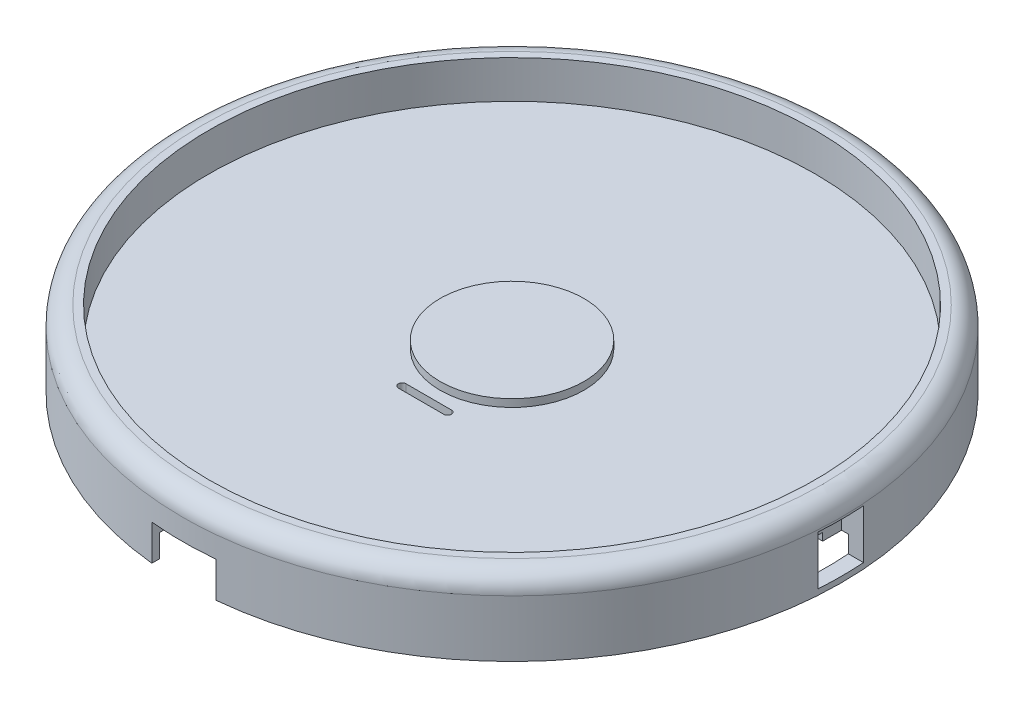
ISO-10303-21;
HEADER;
FILE_DESCRIPTION(('STEP AP214'),'2;1');
FILE_NAME('part.step','',(''),(''),'','','');
FILE_SCHEMA(('AUTOMOTIVE_DESIGN { 1 0 10303 214 1 1 1 1 }'));
ENDSEC;
DATA;
#1=APPLICATION_CONTEXT('core data for automotive mechanical design processes');
#2=APPLICATION_PROTOCOL_DEFINITION('international standard','automotive_design',2000,#1);
#3=PRODUCT_CONTEXT('',#1,'mechanical');
#4=PRODUCT('Part','Part','',(#3));
#5=PRODUCT_RELATED_PRODUCT_CATEGORY('part','',(#4));
#6=PRODUCT_DEFINITION_FORMATION('','',#4);
#7=PRODUCT_DEFINITION_CONTEXT('part definition',#1,'design');
#8=PRODUCT_DEFINITION('design','',#6,#7);
#9=PRODUCT_DEFINITION_SHAPE('','',#8);
#10=(LENGTH_UNIT() NAMED_UNIT(*) SI_UNIT(.MILLI.,.METRE.));
#11=(NAMED_UNIT(*) PLANE_ANGLE_UNIT() SI_UNIT($,.RADIAN.));
#12=(NAMED_UNIT(*) SI_UNIT($,.STERADIAN.) SOLID_ANGLE_UNIT());
#13=UNCERTAINTY_MEASURE_WITH_UNIT(LENGTH_MEASURE(1.E-05),#10,'distance_accuracy_value','');
#14=(GEOMETRIC_REPRESENTATION_CONTEXT(3) GLOBAL_UNCERTAINTY_ASSIGNED_CONTEXT((#13)) GLOBAL_UNIT_ASSIGNED_CONTEXT((#10,
#11,#12)) REPRESENTATION_CONTEXT('',''));
#15=CARTESIAN_POINT('',(0.,0.,0.));
#16=DIRECTION('',(0.,0.,1.));
#17=DIRECTION('',(1.,0.,0.));
#18=AXIS2_PLACEMENT_3D('',#15,#16,#17);
#19=CARTESIAN_POINT('',(3.,4.,11.5));
#20=DIRECTION('',(0.,1.,0.));
#21=DIRECTION('',(0.,0.,1.));
#22=AXIS2_PLACEMENT_3D('',#19,#20,#21);
#23=CYLINDRICAL_SURFACE('',#22,0.500000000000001);
#24=CARTESIAN_POINT('',(3.,4.,11.5));
#25=DIRECTION('',(0.,1.,0.));
#26=DIRECTION('',(0.,0.,1.));
#27=AXIS2_PLACEMENT_3D('',#24,#25,#26);
#28=CIRCLE('',#27,0.500000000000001);
#29=CARTESIAN_POINT('',(3.5,4.,11.5));
#30=VERTEX_POINT('',#29);
#31=CARTESIAN_POINT('',(3.,4.,11.));
#32=VERTEX_POINT('',#31);
#33=EDGE_CURVE('E584',#30,#32,#28,.T.);
#34=ORIENTED_EDGE('',*,*,#33,.F.);
#35=DIRECTION('',(0.,-1.,0.));
#36=VECTOR('',#35,1.);
#37=CARTESIAN_POINT('',(3.5,4.,11.5));
#38=LINE('',#37,#36);
#39=CARTESIAN_POINT('',(3.5,3.,11.5));
#40=VERTEX_POINT('',#39);
#41=EDGE_CURVE('E391',#40,#30,#38,.F.);
#42=ORIENTED_EDGE('',*,*,#41,.F.);
#43=CARTESIAN_POINT('',(3.,3.,11.5));
#44=DIRECTION('',(0.,-1.,0.));
#45=DIRECTION('',(0.,0.,-1.));
#46=AXIS2_PLACEMENT_3D('',#43,#44,#45);
#47=CIRCLE('',#46,0.500000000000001);
#48=CARTESIAN_POINT('',(3.,3.,12.));
#49=VERTEX_POINT('',#48);
#50=EDGE_CURVE('E42',#40,#49,#47,.T.);
#51=ORIENTED_EDGE('',*,*,#50,.T.);
#52=DIRECTION('',(0.,-1.,0.));
#53=VECTOR('',#52,1.);
#54=CARTESIAN_POINT('',(3.,4.,12.));
#55=LINE('',#54,#53);
#56=CARTESIAN_POINT('',(3.,5.,12.));
#57=VERTEX_POINT('',#56);
#58=EDGE_CURVE('E588',#57,#49,#55,.T.);
#59=ORIENTED_EDGE('',*,*,#58,.F.);
#60=CARTESIAN_POINT('',(3.,5.,11.5));
#61=DIRECTION('',(0.,1.,0.));
#62=DIRECTION('',(0.,0.,1.));
#63=AXIS2_PLACEMENT_3D('',#60,#61,#62);
#64=CIRCLE('',#63,0.500000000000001);
#65=CARTESIAN_POINT('',(2.99999999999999,5.,11.));
#66=VERTEX_POINT('',#65);
#67=EDGE_CURVE('E11',#57,#66,#64,.T.);
#68=ORIENTED_EDGE('',*,*,#67,.T.);
#69=DIRECTION('',(0.,-1.,0.));
#70=VECTOR('',#69,1.);
#71=CARTESIAN_POINT('',(3.,4.,11.));
#72=LINE('',#71,#70);
#73=EDGE_CURVE('E586',#32,#66,#72,.F.);
#74=ORIENTED_EDGE('',*,*,#73,.F.);
#75=EDGE_LOOP('',(#34,#42,#51,#59,#68,#74));
#76=FACE_BOUND('',#75,.T.);
#77=ADVANCED_FACE('F35',(#76),#23,.F.);
#78=CARTESIAN_POINT('',(-3.,5.,11.5));
#79=DIRECTION('',(0.,1.,0.));
#80=DIRECTION('',(0.,0.,1.));
#81=AXIS2_PLACEMENT_3D('',#78,#79,#80);
#82=CYLINDRICAL_SURFACE('',#81,0.5);
#83=CARTESIAN_POINT('',(-3.,4.,11.5));
#84=DIRECTION('',(0.,1.,0.));
#85=DIRECTION('',(0.,0.,1.));
#86=AXIS2_PLACEMENT_3D('',#83,#84,#85);
#87=CIRCLE('',#86,0.5);
#88=CARTESIAN_POINT('',(-3.,4.,11.));
#89=VERTEX_POINT('',#88);
#90=CARTESIAN_POINT('',(-3.5,4.,11.5));
#91=VERTEX_POINT('',#90);
#92=EDGE_CURVE('E598',#89,#91,#87,.T.);
#93=ORIENTED_EDGE('',*,*,#92,.F.);
#94=DIRECTION('',(0.,-1.,0.));
#95=VECTOR('',#94,1.);
#96=CARTESIAN_POINT('',(-3.,5.,11.));
#97=LINE('',#96,#95);
#98=CARTESIAN_POINT('',(-3.,5.,11.));
#99=VERTEX_POINT('',#98);
#100=EDGE_CURVE('E607',#99,#89,#97,.T.);
#101=ORIENTED_EDGE('',*,*,#100,.F.);
#102=CARTESIAN_POINT('',(-3.,5.,11.5));
#103=DIRECTION('',(0.,1.,0.));
#104=DIRECTION('',(0.,0.,1.));
#105=AXIS2_PLACEMENT_3D('',#102,#103,#104);
#106=CIRCLE('',#105,0.5);
#107=CARTESIAN_POINT('',(-3.,5.,12.));
#108=VERTEX_POINT('',#107);
#109=EDGE_CURVE('E596',#99,#108,#106,.T.);
#110=ORIENTED_EDGE('',*,*,#109,.T.);
#111=DIRECTION('',(0.,-1.,0.));
#112=VECTOR('',#111,1.);
#113=CARTESIAN_POINT('',(-3.,5.,12.));
#114=LINE('',#113,#112);
#115=CARTESIAN_POINT('',(-3.,3.,12.));
#116=VERTEX_POINT('',#115);
#117=EDGE_CURVE('E601',#116,#108,#114,.F.);
#118=ORIENTED_EDGE('',*,*,#117,.F.);
#119=CARTESIAN_POINT('',(-3.,3.,11.5));
#120=DIRECTION('',(0.,-1.,0.));
#121=DIRECTION('',(0.,0.,-1.));
#122=AXIS2_PLACEMENT_3D('',#119,#120,#121);
#123=CIRCLE('',#122,0.5);
#124=CARTESIAN_POINT('',(-3.5,3.,11.5));
#125=VERTEX_POINT('',#124);
#126=EDGE_CURVE('E594',#116,#125,#123,.T.);
#127=ORIENTED_EDGE('',*,*,#126,.T.);
#128=DIRECTION('',(0.,-1.,0.));
#129=VECTOR('',#128,1.);
#130=CARTESIAN_POINT('',(-3.5,5.,11.5));
#131=LINE('',#130,#129);
#132=EDGE_CURVE('E604',#91,#125,#131,.T.);
#133=ORIENTED_EDGE('',*,*,#132,.F.);
#134=EDGE_LOOP('',(#93,#101,#110,#118,#127,#133));
#135=FACE_BOUND('',#134,.T.);
#136=ADVANCED_FACE('F577',(#135),#82,.F.);
#137=CARTESIAN_POINT('',(0.,3.,0.));
#138=DIRECTION('',(0.,-1.,0.));
#139=DIRECTION('',(0.,0.,-1.));
#140=AXIS2_PLACEMENT_3D('',#137,#138,#139);
#141=PLANE('',#140);
#142=ORIENTED_EDGE('',*,*,#50,.F.);
#143=DIRECTION('',(0.,0.,-1.));
#144=VECTOR('',#143,1.);
#145=CARTESIAN_POINT('',(3.49999999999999,3.,0.));
#146=LINE('',#145,#144);
#147=CARTESIAN_POINT('',(3.5,3.,6.6332495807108));
#148=VERTEX_POINT('',#147);
#149=EDGE_CURVE('E649',#40,#148,#146,.T.);
#150=ORIENTED_EDGE('',*,*,#149,.T.);
#151=CARTESIAN_POINT('',(0.,3.,0.));
#152=DIRECTION('',(0.,1.,0.));
#153=DIRECTION('',(0.,0.,1.));
#154=AXIS2_PLACEMENT_3D('',#151,#152,#153);
#155=CIRCLE('',#154,7.5);
#156=CARTESIAN_POINT('',(7.48331477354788,3.,0.5));
#157=VERTEX_POINT('',#156);
#158=EDGE_CURVE('E402',#148,#157,#155,.T.);
#159=ORIENTED_EDGE('',*,*,#158,.T.);
#160=DIRECTION('',(1.,0.,0.));
#161=VECTOR('',#160,1.);
#162=CARTESIAN_POINT('',(0.500000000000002,3.,0.5));
#163=LINE('',#162,#161);
#164=CARTESIAN_POINT('',(40.5,3.,0.5));
#165=VERTEX_POINT('',#164);
#166=EDGE_CURVE('E1046',#157,#165,#163,.T.);
#167=ORIENTED_EDGE('',*,*,#166,.T.);
#168=DIRECTION('',(0.,0.,1.));
#169=VECTOR('',#168,1.);
#170=CARTESIAN_POINT('',(40.5,3.,0.));
#171=LINE('',#170,#169);
#172=CARTESIAN_POINT('',(40.5,3.,3.));
#173=VERTEX_POINT('',#172);
#174=EDGE_CURVE('E641',#165,#173,#171,.T.);
#175=ORIENTED_EDGE('',*,*,#174,.T.);
#176=DIRECTION('',(-1.,0.,0.));
#177=VECTOR('',#176,1.);
#178=CARTESIAN_POINT('',(0.,3.,3.));
#179=LINE('',#178,#177);
#180=CARTESIAN_POINT('',(41.391424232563,3.,3.));
#181=VERTEX_POINT('',#180);
#182=EDGE_CURVE('E861',#181,#173,#179,.T.);
#183=ORIENTED_EDGE('',*,*,#182,.F.);
#184=CARTESIAN_POINT('',(0.,3.,0.));
#185=DIRECTION('',(0.,1.,0.));
#186=DIRECTION('',(0.,0.,1.));
#187=AXIS2_PLACEMENT_3D('',#184,#185,#186);
#188=CIRCLE('',#187,41.5);
#189=CARTESIAN_POINT('',(12.5,3.,39.5727178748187));
#190=VERTEX_POINT('',#189);
#191=EDGE_CURVE('E413',#181,#190,#188,.F.);
#192=ORIENTED_EDGE('',*,*,#191,.T.);
#193=DIRECTION('',(0.,0.,-1.));
#194=VECTOR('',#193,1.);
#195=CARTESIAN_POINT('',(12.5,3.,0.));
#196=LINE('',#195,#194);
#197=CARTESIAN_POINT('',(12.5,3.,17.5));
#198=VERTEX_POINT('',#197);
#199=EDGE_CURVE('E730',#190,#198,#196,.T.);
#200=ORIENTED_EDGE('',*,*,#199,.T.);
#201=DIRECTION('',(-1.,0.,0.));
#202=VECTOR('',#201,1.);
#203=CARTESIAN_POINT('',(0.,3.,17.5));
#204=LINE('',#203,#202);
#205=CARTESIAN_POINT('',(3.49999999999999,3.,17.5));
#206=VERTEX_POINT('',#205);
#207=EDGE_CURVE('E716',#198,#206,#204,.T.);
#208=ORIENTED_EDGE('',*,*,#207,.T.);
#209=DIRECTION('',(0.,0.,-1.));
#210=VECTOR('',#209,1.);
#211=CARTESIAN_POINT('',(3.49999999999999,3.,19.5));
#212=LINE('',#211,#210);
#213=CARTESIAN_POINT('',(3.49999999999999,3.,19.5));
#214=VERTEX_POINT('',#213);
#215=EDGE_CURVE('E773',#214,#206,#212,.T.);
#216=ORIENTED_EDGE('',*,*,#215,.F.);
#217=DIRECTION('',(1.,0.,0.));
#218=VECTOR('',#217,1.);
#219=CARTESIAN_POINT('',(-10.5,3.,19.5));
#220=LINE('',#219,#218);
#221=CARTESIAN_POINT('',(10.5,3.,19.5));
#222=VERTEX_POINT('',#221);
#223=EDGE_CURVE('E719',#214,#222,#220,.T.);
#224=ORIENTED_EDGE('',*,*,#223,.T.);
#225=DIRECTION('',(0.,0.,1.));
#226=VECTOR('',#225,1.);
#227=CARTESIAN_POINT('',(10.5,3.,43.5));
#228=LINE('',#227,#226);
#229=CARTESIAN_POINT('',(10.5,2.9999999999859,41.182520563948));
#230=VERTEX_POINT('',#229);
#231=EDGE_CURVE('E710',#222,#230,#228,.T.);
#232=ORIENTED_EDGE('',*,*,#231,.T.);
#233=CARTESIAN_POINT('',(0.,2.9999999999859,0.));
#234=DIRECTION('',(0.,-1.,0.));
#235=DIRECTION('',(0.,0.,-1.));
#236=AXIS2_PLACEMENT_3D('',#233,#234,#235);
#237=CIRCLE('',#236,42.5);
#238=CARTESIAN_POINT('',(4.25,3.,42.2869660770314));
#239=VERTEX_POINT('',#238);
#240=EDGE_CURVE('E833',#230,#239,#237,.T.);
#241=ORIENTED_EDGE('',*,*,#240,.T.);
#242=DIRECTION('',(0.,0.,-1.));
#243=VECTOR('',#242,1.);
#244=CARTESIAN_POINT('',(4.25,3.,43.5));
#245=LINE('',#244,#243);
#246=CARTESIAN_POINT('',(4.25,3.,37.));
#247=VERTEX_POINT('',#246);
#248=EDGE_CURVE('E696',#239,#247,#245,.T.);
#249=ORIENTED_EDGE('',*,*,#248,.T.);
#250=DIRECTION('',(-1.,0.,0.));
#251=VECTOR('',#250,1.);
#252=CARTESIAN_POINT('',(-4.25,3.,37.));
#253=LINE('',#252,#251);
#254=CARTESIAN_POINT('',(0.5,3.,37.));
#255=VERTEX_POINT('',#254);
#256=EDGE_CURVE('E656',#247,#255,#253,.T.);
#257=ORIENTED_EDGE('',*,*,#256,.T.);
#258=DIRECTION('',(0.,0.,-1.));
#259=VECTOR('',#258,1.);
#260=CARTESIAN_POINT('',(0.5,3.,37.));
#261=LINE('',#260,#259);
#262=CARTESIAN_POINT('',(0.500000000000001,3.,12.));
#263=VERTEX_POINT('',#262);
#264=EDGE_CURVE('E1079',#255,#263,#261,.T.);
#265=ORIENTED_EDGE('',*,*,#264,.T.);
#266=DIRECTION('',(1.,0.,0.));
#267=VECTOR('',#266,1.);
#268=CARTESIAN_POINT('',(0.,3.,12.));
#269=LINE('',#268,#267);
#270=EDGE_CURVE('E653',#263,#49,#269,.T.);
#271=ORIENTED_EDGE('',*,*,#270,.T.);
#272=EDGE_LOOP('',(#142,#150,#159,#167,#175,#183,#192,#200,#208,#216,#224,#232,#241,#249,#257,
#265,#271));
#273=FACE_BOUND('',#272,.T.);
#274=ADVANCED_FACE('F581',(#273),#141,.T.);
#275=DIRECTION('',(1.,0.,0.));
#276=VECTOR('',#275,1.);
#277=CARTESIAN_POINT('',(0.500000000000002,3.,-0.5));
#278=LINE('',#277,#276);
#279=CARTESIAN_POINT('',(7.48331477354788,3.,-0.5));
#280=VERTEX_POINT('',#279);
#281=CARTESIAN_POINT('',(40.5,3.,-0.5));
#282=VERTEX_POINT('',#281);
#283=EDGE_CURVE('E1041',#280,#282,#278,.T.);
#284=ORIENTED_EDGE('',*,*,#283,.F.);
#285=CARTESIAN_POINT('',(0.500000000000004,3.,-7.48331477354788));
#286=VERTEX_POINT('',#285);
#287=EDGE_CURVE('E425',#280,#286,#155,.T.);
#288=ORIENTED_EDGE('',*,*,#287,.T.);
#289=DIRECTION('',(0.,0.,-1.));
#290=VECTOR('',#289,1.);
#291=CARTESIAN_POINT('',(0.500000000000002,3.,-0.5));
#292=LINE('',#291,#290);
#293=CARTESIAN_POINT('',(0.500000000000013,3.,-31.5));
#294=VERTEX_POINT('',#293);
#295=EDGE_CURVE('E1045',#286,#294,#292,.T.);
#296=ORIENTED_EDGE('',*,*,#295,.T.);
#297=DIRECTION('',(1.,0.,0.));
#298=VECTOR('',#297,1.);
#299=CARTESIAN_POINT('',(0.,3.,-31.5));
#300=LINE('',#299,#298);
#301=CARTESIAN_POINT('',(2.29619250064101,3.,-31.5));
#302=VERTEX_POINT('',#301);
#303=EDGE_CURVE('E613',#294,#302,#300,.T.);
#304=ORIENTED_EDGE('',*,*,#303,.T.);
#305=DIRECTION('',(0.,0.,1.));
#306=VECTOR('',#305,1.);
#307=CARTESIAN_POINT('',(2.29619250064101,3.,-43.501));
#308=LINE('',#307,#306);
#309=CARTESIAN_POINT('',(2.29619250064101,3.00000000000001,-41.4364272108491));
#310=VERTEX_POINT('',#309);
#311=EDGE_CURVE('E1006',#302,#310,#308,.F.);
#312=ORIENTED_EDGE('',*,*,#311,.T.);
#313=CARTESIAN_POINT('',(41.391424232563,3.,-3.));
#314=VERTEX_POINT('',#313);
#315=EDGE_CURVE('E737',#310,#314,#188,.F.);
#316=ORIENTED_EDGE('',*,*,#315,.T.);
#317=DIRECTION('',(1.,0.,0.));
#318=VECTOR('',#317,1.);
#319=CARTESIAN_POINT('',(0.,3.,-3.));
#320=LINE('',#319,#318);
#321=CARTESIAN_POINT('',(40.5,3.,-3.));
#322=VERTEX_POINT('',#321);
#323=EDGE_CURVE('E770',#322,#314,#320,.T.);
#324=ORIENTED_EDGE('',*,*,#323,.F.);
#325=EDGE_CURVE('E638',#322,#282,#171,.T.);
#326=ORIENTED_EDGE('',*,*,#325,.T.);
#327=EDGE_LOOP('',(#284,#288,#296,#304,#312,#316,#324,#326));
#328=FACE_BOUND('',#327,.T.);
#329=ADVANCED_FACE('F1028',(#328),#141,.T.);
#330=ORIENTED_EDGE('',*,*,#126,.F.);
#331=CARTESIAN_POINT('',(-0.500000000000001,3.,12.));
#332=VERTEX_POINT('',#331);
#333=EDGE_CURVE('E651',#116,#332,#269,.T.);
#334=ORIENTED_EDGE('',*,*,#333,.T.);
#335=DIRECTION('',(0.,0.,-1.));
#336=VECTOR('',#335,1.);
#337=CARTESIAN_POINT('',(-0.5,3.,37.));
#338=LINE('',#337,#336);
#339=CARTESIAN_POINT('',(-0.5,3.,37.));
#340=VERTEX_POINT('',#339);
#341=EDGE_CURVE('E942',#340,#332,#338,.T.);
#342=ORIENTED_EDGE('',*,*,#341,.F.);
#343=CARTESIAN_POINT('',(-4.25,3.,37.));
#344=VERTEX_POINT('',#343);
#345=EDGE_CURVE('E659',#340,#344,#253,.T.);
#346=ORIENTED_EDGE('',*,*,#345,.T.);
#347=DIRECTION('',(0.,0.,1.));
#348=VECTOR('',#347,1.);
#349=CARTESIAN_POINT('',(-4.25,3.,43.5));
#350=LINE('',#349,#348);
#351=CARTESIAN_POINT('',(-4.25,2.9999999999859,42.2869660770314));
#352=VERTEX_POINT('',#351);
#353=EDGE_CURVE('E698',#344,#352,#350,.T.);
#354=ORIENTED_EDGE('',*,*,#353,.T.);
#355=CARTESIAN_POINT('',(0.,2.9999999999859,0.));
#356=DIRECTION('',(0.,-1.,0.));
#357=DIRECTION('',(0.,0.,-1.));
#358=AXIS2_PLACEMENT_3D('',#355,#356,#357);
#359=CIRCLE('',#358,42.5);
#360=CARTESIAN_POINT('',(-10.5,2.9999999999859,41.182520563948));
#361=VERTEX_POINT('',#360);
#362=EDGE_CURVE('E847',#352,#361,#359,.T.);
#363=ORIENTED_EDGE('',*,*,#362,.T.);
#364=DIRECTION('',(0.,0.,-1.));
#365=VECTOR('',#364,1.);
#366=CARTESIAN_POINT('',(-10.5,3.,43.5));
#367=LINE('',#366,#365);
#368=CARTESIAN_POINT('',(-10.5,3.,19.5));
#369=VERTEX_POINT('',#368);
#370=EDGE_CURVE('E720',#361,#369,#367,.T.);
#371=ORIENTED_EDGE('',*,*,#370,.T.);
#372=CARTESIAN_POINT('',(-3.50000000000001,3.,19.5));
#373=VERTEX_POINT('',#372);
#374=EDGE_CURVE('E704',#369,#373,#220,.T.);
#375=ORIENTED_EDGE('',*,*,#374,.T.);
#376=DIRECTION('',(0.,0.,1.));
#377=VECTOR('',#376,1.);
#378=CARTESIAN_POINT('',(-3.50000000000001,3.,19.5));
#379=LINE('',#378,#377);
#380=CARTESIAN_POINT('',(-3.50000000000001,3.,17.5));
#381=VERTEX_POINT('',#380);
#382=EDGE_CURVE('E778',#381,#373,#379,.T.);
#383=ORIENTED_EDGE('',*,*,#382,.F.);
#384=CARTESIAN_POINT('',(-12.5,3.,17.5));
#385=VERTEX_POINT('',#384);
#386=EDGE_CURVE('E726',#381,#385,#204,.T.);
#387=ORIENTED_EDGE('',*,*,#386,.T.);
#388=DIRECTION('',(0.,0.,1.));
#389=VECTOR('',#388,1.);
#390=CARTESIAN_POINT('',(-12.5,3.,0.));
#391=LINE('',#390,#389);
#392=CARTESIAN_POINT('',(-12.5,3.,39.5727178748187));
#393=VERTEX_POINT('',#392);
#394=EDGE_CURVE('E727',#385,#393,#391,.T.);
#395=ORIENTED_EDGE('',*,*,#394,.T.);
#396=CARTESIAN_POINT('',(-41.391424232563,3.,3.));
#397=VERTEX_POINT('',#396);
#398=EDGE_CURVE('E733',#393,#397,#188,.F.);
#399=ORIENTED_EDGE('',*,*,#398,.T.);
#400=DIRECTION('',(1.,0.,0.));
#401=VECTOR('',#400,1.);
#402=CARTESIAN_POINT('',(0.,3.,3.));
#403=LINE('',#402,#401);
#404=CARTESIAN_POINT('',(-40.5,3.,3.));
#405=VERTEX_POINT('',#404);
#406=EDGE_CURVE('E807',#397,#405,#403,.T.);
#407=ORIENTED_EDGE('',*,*,#406,.T.);
#408=DIRECTION('',(0.,0.,-1.));
#409=VECTOR('',#408,1.);
#410=CARTESIAN_POINT('',(-40.5,3.,0.));
#411=LINE('',#410,#409);
#412=CARTESIAN_POINT('',(-40.5,3.,0.5));
#413=VERTEX_POINT('',#412);
#414=EDGE_CURVE('E616',#405,#413,#411,.T.);
#415=ORIENTED_EDGE('',*,*,#414,.T.);
#416=DIRECTION('',(1.,0.,0.));
#417=VECTOR('',#416,1.);
#418=CARTESIAN_POINT('',(-40.5,3.,0.5));
#419=LINE('',#418,#417);
#420=CARTESIAN_POINT('',(-7.48331477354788,3.,0.5));
#421=VERTEX_POINT('',#420);
#422=EDGE_CURVE('E948',#413,#421,#419,.T.);
#423=ORIENTED_EDGE('',*,*,#422,.T.);
#424=CARTESIAN_POINT('',(-3.5,3.,6.6332495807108));
#425=VERTEX_POINT('',#424);
#426=EDGE_CURVE('E426',#421,#425,#155,.T.);
#427=ORIENTED_EDGE('',*,*,#426,.T.);
#428=DIRECTION('',(0.,0.,1.));
#429=VECTOR('',#428,1.);
#430=CARTESIAN_POINT('',(-3.5,3.,0.));
#431=LINE('',#430,#429);
#432=EDGE_CURVE('E654',#425,#125,#431,.T.);
#433=ORIENTED_EDGE('',*,*,#432,.T.);
#434=EDGE_LOOP('',(#330,#334,#342,#346,#354,#363,#371,#375,#383,#387,#395,#399,#407,#415,#423,
#427,#433));
#435=FACE_BOUND('',#434,.T.);
#436=ADVANCED_FACE('F893',(#435),#141,.T.);
#437=CARTESIAN_POINT('',(-4.25,4.7,37.));
#438=DIRECTION('',(0.,0.,-1.));
#439=DIRECTION('',(-1.,0.,0.));
#440=AXIS2_PLACEMENT_3D('',#437,#438,#439);
#441=PLANE('',#440);
#442=DIRECTION('',(0.,-1.,0.));
#443=VECTOR('',#442,1.);
#444=CARTESIAN_POINT('',(0.5,4.,37.));
#445=LINE('',#444,#443);
#446=CARTESIAN_POINT('',(0.5,4.,37.));
#447=VERTEX_POINT('',#446);
#448=EDGE_CURVE('E934',#447,#255,#445,.T.);
#449=ORIENTED_EDGE('',*,*,#448,.T.);
#450=ORIENTED_EDGE('',*,*,#256,.F.);
#451=DIRECTION('',(0.,-1.,0.));
#452=VECTOR('',#451,1.);
#453=CARTESIAN_POINT('',(4.25,4.7,37.));
#454=LINE('',#453,#452);
#455=CARTESIAN_POINT('',(4.25,4.7,37.));
#456=VERTEX_POINT('',#455);
#457=EDGE_CURVE('E682',#456,#247,#454,.T.);
#458=ORIENTED_EDGE('',*,*,#457,.F.);
#459=DIRECTION('',(1.,0.,0.));
#460=VECTOR('',#459,1.);
#461=CARTESIAN_POINT('',(-4.25,4.7,37.));
#462=LINE('',#461,#460);
#463=CARTESIAN_POINT('',(-4.25,4.7,37.));
#464=VERTEX_POINT('',#463);
#465=EDGE_CURVE('E686',#464,#456,#462,.T.);
#466=ORIENTED_EDGE('',*,*,#465,.F.);
#467=DIRECTION('',(0.,-1.,0.));
#468=VECTOR('',#467,1.);
#469=CARTESIAN_POINT('',(-4.25,4.7,37.));
#470=LINE('',#469,#468);
#471=EDGE_CURVE('E683',#464,#344,#470,.T.);
#472=ORIENTED_EDGE('',*,*,#471,.T.);
#473=ORIENTED_EDGE('',*,*,#345,.F.);
#474=DIRECTION('',(0.,-1.,0.));
#475=VECTOR('',#474,1.);
#476=CARTESIAN_POINT('',(-0.5,4.,37.));
#477=LINE('',#476,#475);
#478=CARTESIAN_POINT('',(-0.5,4.,37.));
#479=VERTEX_POINT('',#478);
#480=EDGE_CURVE('E956',#479,#340,#477,.T.);
#481=ORIENTED_EDGE('',*,*,#480,.F.);
#482=DIRECTION('',(1.,0.,0.));
#483=VECTOR('',#482,1.);
#484=CARTESIAN_POINT('',(-0.5,4.,37.));
#485=LINE('',#484,#483);
#486=EDGE_CURVE('E947',#479,#447,#485,.T.);
#487=ORIENTED_EDGE('',*,*,#486,.T.);
#488=EDGE_LOOP('',(#449,#450,#458,#466,#472,#473,#481,#487));
#489=FACE_BOUND('',#488,.T.);
#490=ADVANCED_FACE('F930',(#489),#441,.F.);
#491=CARTESIAN_POINT('',(0.,6.,0.));
#492=DIRECTION('',(0.,-1.,0.));
#493=DIRECTION('',(0.,0.,-1.));
#494=AXIS2_PLACEMENT_3D('',#491,#492,#493);
#495=CYLINDRICAL_SURFACE('',#494,7.5);
#496=DIRECTION('',(0.,-1.,0.));
#497=VECTOR('',#496,1.);
#498=CARTESIAN_POINT('',(3.5,12.2503641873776,6.6332495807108));
#499=LINE('',#498,#497);
#500=CARTESIAN_POINT('',(3.5,4.,6.6332495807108));
#501=VERTEX_POINT('',#500);
#502=EDGE_CURVE('E389',#501,#148,#499,.T.);
#503=ORIENTED_EDGE('',*,*,#502,.F.);
#504=CARTESIAN_POINT('',(0.,4.,0.));
#505=DIRECTION('',(0.,1.,0.));
#506=DIRECTION('',(0.,0.,1.));
#507=AXIS2_PLACEMENT_3D('',#504,#505,#506);
#508=CIRCLE('',#507,7.5);
#509=CARTESIAN_POINT('',(7.48331477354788,4.,0.5));
#510=VERTEX_POINT('',#509);
#511=EDGE_CURVE('E400',#501,#510,#508,.T.);
#512=ORIENTED_EDGE('',*,*,#511,.T.);
#513=DIRECTION('',(0.,-1.,0.));
#514=VECTOR('',#513,1.);
#515=CARTESIAN_POINT('',(7.48331477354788,6.,0.5));
#516=LINE('',#515,#514);
#517=EDGE_CURVE('E991',#510,#157,#516,.T.);
#518=ORIENTED_EDGE('',*,*,#517,.T.);
#519=ORIENTED_EDGE('',*,*,#158,.F.);
#520=EDGE_LOOP('',(#503,#512,#518,#519));
#521=FACE_BOUND('',#520,.T.);
#522=ADVANCED_FACE('F398',(#521),#495,.F.);
#523=DIRECTION('',(0.,-1.,0.));
#524=VECTOR('',#523,1.);
#525=CARTESIAN_POINT('',(7.48331477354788,6.,-0.5));
#526=LINE('',#525,#524);
#527=CARTESIAN_POINT('',(7.48331477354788,4.,-0.5));
#528=VERTEX_POINT('',#527);
#529=EDGE_CURVE('E989',#528,#280,#526,.T.);
#530=ORIENTED_EDGE('',*,*,#529,.F.);
#531=CARTESIAN_POINT('',(0.500000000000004,4.,-7.48331477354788));
#532=VERTEX_POINT('',#531);
#533=EDGE_CURVE('E409',#528,#532,#508,.T.);
#534=ORIENTED_EDGE('',*,*,#533,.T.);
#535=DIRECTION('',(0.,-1.,0.));
#536=VECTOR('',#535,1.);
#537=CARTESIAN_POINT('',(0.500000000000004,6.,-7.48331477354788));
#538=LINE('',#537,#536);
#539=EDGE_CURVE('E982',#532,#286,#538,.T.);
#540=ORIENTED_EDGE('',*,*,#539,.T.);
#541=ORIENTED_EDGE('',*,*,#287,.F.);
#542=EDGE_LOOP('',(#530,#534,#540,#541));
#543=FACE_BOUND('',#542,.T.);
#544=ADVANCED_FACE('F1050',(#543),#495,.F.);
#545=DIRECTION('',(0.,-1.,0.));
#546=VECTOR('',#545,1.);
#547=CARTESIAN_POINT('',(-3.5,12.2503641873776,6.6332495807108));
#548=LINE('',#547,#546);
#549=CARTESIAN_POINT('',(-3.5,4.,6.6332495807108));
#550=VERTEX_POINT('',#549);
#551=EDGE_CURVE('E1081',#550,#425,#548,.T.);
#552=ORIENTED_EDGE('',*,*,#551,.T.);
#553=ORIENTED_EDGE('',*,*,#426,.F.);
#554=DIRECTION('',(0.,-1.,0.));
#555=VECTOR('',#554,1.);
#556=CARTESIAN_POINT('',(-7.48331477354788,6.,0.5));
#557=LINE('',#556,#555);
#558=CARTESIAN_POINT('',(-7.48331477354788,4.,0.5));
#559=VERTEX_POINT('',#558);
#560=EDGE_CURVE('E985',#421,#559,#557,.F.);
#561=ORIENTED_EDGE('',*,*,#560,.T.);
#562=EDGE_CURVE('E411',#559,#550,#508,.T.);
#563=ORIENTED_EDGE('',*,*,#562,.T.);
#564=EDGE_LOOP('',(#552,#553,#561,#563));
#565=FACE_BOUND('',#564,.T.);
#566=ADVANCED_FACE('F567',(#565),#495,.F.);
#567=CARTESIAN_POINT('',(-3.5,0.,12.));
#568=DIRECTION('',(0.,0.,1.));
#569=DIRECTION('',(1.,0.,0.));
#570=AXIS2_PLACEMENT_3D('',#567,#568,#569);
#571=PLANE('',#570);
#572=DIRECTION('',(1.,0.,0.));
#573=VECTOR('',#572,1.);
#574=CARTESIAN_POINT('',(-3.5,5.,12.));
#575=LINE('',#574,#573);
#576=EDGE_CURVE('E786',#108,#57,#575,.T.);
#577=ORIENTED_EDGE('',*,*,#576,.T.);
#578=ORIENTED_EDGE('',*,*,#58,.T.);
#579=ORIENTED_EDGE('',*,*,#270,.F.);
#580=DIRECTION('',(0.,-1.,0.));
#581=VECTOR('',#580,1.);
#582=CARTESIAN_POINT('',(0.500000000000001,0.,12.));
#583=LINE('',#582,#581);
#584=CARTESIAN_POINT('',(0.500000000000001,4.,12.));
#585=VERTEX_POINT('',#584);
#586=EDGE_CURVE('E994',#585,#263,#583,.T.);
#587=ORIENTED_EDGE('',*,*,#586,.F.);
#588=DIRECTION('',(-1.,0.,0.));
#589=VECTOR('',#588,1.);
#590=CARTESIAN_POINT('',(-3.5,4.,12.));
#591=LINE('',#590,#589);
#592=CARTESIAN_POINT('',(-0.500000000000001,4.,12.));
#593=VERTEX_POINT('',#592);
#594=EDGE_CURVE('E977',#585,#593,#591,.T.);
#595=ORIENTED_EDGE('',*,*,#594,.T.);
#596=DIRECTION('',(0.,-1.,0.));
#597=VECTOR('',#596,1.);
#598=CARTESIAN_POINT('',(-0.500000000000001,0.,12.));
#599=LINE('',#598,#597);
#600=EDGE_CURVE('E993',#593,#332,#599,.T.);
#601=ORIENTED_EDGE('',*,*,#600,.T.);
#602=ORIENTED_EDGE('',*,*,#333,.F.);
#603=ORIENTED_EDGE('',*,*,#117,.T.);
#604=EDGE_LOOP('',(#577,#578,#579,#587,#595,#601,#602,#603));
#605=FACE_BOUND('',#604,.T.);
#606=ADVANCED_FACE('F564',(#605),#571,.F.);
#607=CARTESIAN_POINT('',(-3.5,0.,11.));
#608=DIRECTION('',(0.,0.,-1.));
#609=DIRECTION('',(-1.,0.,0.));
#610=AXIS2_PLACEMENT_3D('',#607,#608,#609);
#611=PLANE('',#610);
#612=DIRECTION('',(1.,0.,0.));
#613=VECTOR('',#612,1.);
#614=CARTESIAN_POINT('',(-3.5,4.,11.));
#615=LINE('',#614,#613);
#616=EDGE_CURVE('E975',#89,#32,#615,.T.);
#617=ORIENTED_EDGE('',*,*,#616,.T.);
#618=ORIENTED_EDGE('',*,*,#73,.T.);
#619=DIRECTION('',(-1.,0.,0.));
#620=VECTOR('',#619,1.);
#621=CARTESIAN_POINT('',(-3.5,5.,11.));
#622=LINE('',#621,#620);
#623=EDGE_CURVE('E785',#66,#99,#622,.T.);
#624=ORIENTED_EDGE('',*,*,#623,.T.);
#625=ORIENTED_EDGE('',*,*,#100,.T.);
#626=EDGE_LOOP('',(#617,#618,#624,#625));
#627=FACE_BOUND('',#626,.T.);
#628=ADVANCED_FACE('F537',(#627),#611,.F.);
#629=CARTESIAN_POINT('',(40.5,0.,0.));
#630=DIRECTION('',(1.,0.,0.));
#631=DIRECTION('',(0.,0.,-1.));
#632=AXIS2_PLACEMENT_3D('',#629,#630,#631);
#633=PLANE('',#632);
#634=ORIENTED_EDGE('',*,*,#174,.F.);
#635=DIRECTION('',(0.,-1.,0.));
#636=VECTOR('',#635,1.);
#637=CARTESIAN_POINT('',(40.5,4.,0.5));
#638=LINE('',#637,#636);
#639=CARTESIAN_POINT('',(40.5,4.,0.5));
#640=VERTEX_POINT('',#639);
#641=EDGE_CURVE('E972',#640,#165,#638,.T.);
#642=ORIENTED_EDGE('',*,*,#641,.F.);
#643=DIRECTION('',(0.,0.,-1.));
#644=VECTOR('',#643,1.);
#645=CARTESIAN_POINT('',(40.5,4.,0.5));
#646=LINE('',#645,#644);
#647=CARTESIAN_POINT('',(40.5,4.,-0.5));
#648=VERTEX_POINT('',#647);
#649=EDGE_CURVE('E1065',#640,#648,#646,.T.);
#650=ORIENTED_EDGE('',*,*,#649,.T.);
#651=DIRECTION('',(0.,-1.,0.));
#652=VECTOR('',#651,1.);
#653=CARTESIAN_POINT('',(40.5,4.,-0.5));
#654=LINE('',#653,#652);
#655=EDGE_CURVE('E969',#648,#282,#654,.T.);
#656=ORIENTED_EDGE('',*,*,#655,.T.);
#657=ORIENTED_EDGE('',*,*,#325,.F.);
#658=DIRECTION('',(0.,1.,0.));
#659=VECTOR('',#658,1.);
#660=CARTESIAN_POINT('',(40.5,7.25,-3.));
#661=LINE('',#660,#659);
#662=CARTESIAN_POINT('',(40.5,7.25,-3.));
#663=VERTEX_POINT('',#662);
#664=EDGE_CURVE('E849',#322,#663,#661,.T.);
#665=ORIENTED_EDGE('',*,*,#664,.T.);
#666=DIRECTION('',(0.,0.,1.));
#667=VECTOR('',#666,1.);
#668=CARTESIAN_POINT('',(40.5,7.25,3.));
#669=LINE('',#668,#667);
#670=CARTESIAN_POINT('',(40.5,7.25,3.));
#671=VERTEX_POINT('',#670);
#672=EDGE_CURVE('E851',#663,#671,#669,.T.);
#673=ORIENTED_EDGE('',*,*,#672,.T.);
#674=DIRECTION('',(0.,-1.,0.));
#675=VECTOR('',#674,1.);
#676=CARTESIAN_POINT('',(40.5,7.25,3.));
#677=LINE('',#676,#675);
#678=EDGE_CURVE('E854',#671,#173,#677,.T.);
#679=ORIENTED_EDGE('',*,*,#678,.T.);
#680=EDGE_LOOP('',(#634,#642,#650,#656,#657,#665,#673,#679));
#681=FACE_BOUND('',#680,.T.);
#682=ADVANCED_FACE('F534',(#681),#633,.T.);
#683=CARTESIAN_POINT('',(0.,2.5,-31.5));
#684=DIRECTION('',(0.,0.,-1.));
#685=DIRECTION('',(-1.,0.,0.));
#686=AXIS2_PLACEMENT_3D('',#683,#684,#685);
#687=PLANE('',#686);
#688=ORIENTED_EDGE('',*,*,#303,.F.);
#689=DIRECTION('',(0.,-1.,0.));
#690=VECTOR('',#689,1.);
#691=CARTESIAN_POINT('',(0.500000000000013,4.,-31.5));
#692=LINE('',#691,#690);
#693=CARTESIAN_POINT('',(0.500000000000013,4.,-31.5));
#694=VERTEX_POINT('',#693);
#695=EDGE_CURVE('E967',#694,#294,#692,.T.);
#696=ORIENTED_EDGE('',*,*,#695,.F.);
#697=DIRECTION('',(1.,0.,0.));
#698=VECTOR('',#697,1.);
#699=CARTESIAN_POINT('',(-0.500000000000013,4.,-31.5));
#700=LINE('',#699,#698);
#701=CARTESIAN_POINT('',(-0.500000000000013,4.,-31.5));
#702=VERTEX_POINT('',#701);
#703=EDGE_CURVE('E1060',#702,#694,#700,.T.);
#704=ORIENTED_EDGE('',*,*,#703,.F.);
#705=DIRECTION('',(0.,-1.,0.));
#706=VECTOR('',#705,1.);
#707=CARTESIAN_POINT('',(-0.500000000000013,4.,-31.5));
#708=LINE('',#707,#706);
#709=CARTESIAN_POINT('',(-0.500000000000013,3.,-31.5));
#710=VERTEX_POINT('',#709);
#711=EDGE_CURVE('E964',#702,#710,#708,.T.);
#712=ORIENTED_EDGE('',*,*,#711,.T.);
#713=CARTESIAN_POINT('',(-2.29619250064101,3.,-31.5));
#714=VERTEX_POINT('',#713);
#715=EDGE_CURVE('E610',#714,#710,#300,.T.);
#716=ORIENTED_EDGE('',*,*,#715,.F.);
#717=CARTESIAN_POINT('',(0.,2.5,-31.5));
#718=DIRECTION('',(0.,0.,-1.));
#719=DIRECTION('',(-1.,0.,0.));
#720=AXIS2_PLACEMENT_3D('',#717,#718,#719);
#721=CIRCLE('',#720,2.35);
#722=EDGE_CURVE('E493',#714,#302,#721,.T.);
#723=ORIENTED_EDGE('',*,*,#722,.T.);
#724=EDGE_LOOP('',(#688,#696,#704,#712,#716,#723));
#725=FACE_BOUND('',#724,.T.);
#726=ADVANCED_FACE('F504',(#725),#687,.T.);
#727=DIRECTION('',(0.,0.,-1.));
#728=VECTOR('',#727,1.);
#729=CARTESIAN_POINT('',(-0.500000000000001,3.,-0.5));
#730=LINE('',#729,#728);
#731=CARTESIAN_POINT('',(-0.500000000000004,3.,-7.48331477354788));
#732=VERTEX_POINT('',#731);
#733=EDGE_CURVE('E1084',#732,#710,#730,.T.);
#734=ORIENTED_EDGE('',*,*,#733,.F.);
#735=CARTESIAN_POINT('',(-7.48331477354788,3.,-0.5));
#736=VERTEX_POINT('',#735);
#737=EDGE_CURVE('E431',#732,#736,#155,.T.);
#738=ORIENTED_EDGE('',*,*,#737,.T.);
#739=DIRECTION('',(1.,0.,0.));
#740=VECTOR('',#739,1.);
#741=CARTESIAN_POINT('',(-40.5,3.,-0.5));
#742=LINE('',#741,#740);
#743=CARTESIAN_POINT('',(-40.5,3.,-0.5));
#744=VERTEX_POINT('',#743);
#745=EDGE_CURVE('E952',#744,#736,#742,.T.);
#746=ORIENTED_EDGE('',*,*,#745,.F.);
#747=CARTESIAN_POINT('',(-40.5,3.,-3.));
#748=VERTEX_POINT('',#747);
#749=EDGE_CURVE('E619',#744,#748,#411,.T.);
#750=ORIENTED_EDGE('',*,*,#749,.T.);
#751=DIRECTION('',(-1.,0.,0.));
#752=VECTOR('',#751,1.);
#753=CARTESIAN_POINT('',(0.,3.,-3.));
#754=LINE('',#753,#752);
#755=CARTESIAN_POINT('',(-41.391424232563,3.,-3.));
#756=VERTEX_POINT('',#755);
#757=EDGE_CURVE('E820',#748,#756,#754,.T.);
#758=ORIENTED_EDGE('',*,*,#757,.T.);
#759=CARTESIAN_POINT('',(-2.29619250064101,3.00000000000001,-41.4364272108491));
#760=VERTEX_POINT('',#759);
#761=EDGE_CURVE('E736',#756,#760,#188,.F.);
#762=ORIENTED_EDGE('',*,*,#761,.T.);
#763=DIRECTION('',(0.,0.,1.));
#764=VECTOR('',#763,1.);
#765=CARTESIAN_POINT('',(-2.29619250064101,3.,-43.501));
#766=LINE('',#765,#764);
#767=EDGE_CURVE('E492',#760,#714,#766,.T.);
#768=ORIENTED_EDGE('',*,*,#767,.T.);
#769=ORIENTED_EDGE('',*,*,#715,.T.);
#770=EDGE_LOOP('',(#734,#738,#746,#750,#758,#762,#768,#769));
#771=FACE_BOUND('',#770,.T.);
#772=ADVANCED_FACE('F796',(#771),#141,.T.);
#773=CARTESIAN_POINT('',(0.,10.,0.));
#774=DIRECTION('',(0.,-1.,0.));
#775=DIRECTION('',(0.,0.,-1.));
#776=AXIS2_PLACEMENT_3D('',#773,#774,#775);
#777=CYLINDRICAL_SURFACE('',#776,43.5);
#778=DIRECTION('',(0.,-1.,0.));
#779=VECTOR('',#778,1.);
#780=CARTESIAN_POINT('',(4.25,10.,43.2918872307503));
#781=LINE('',#780,#779);
#782=CARTESIAN_POINT('',(4.25,4.7,43.2918872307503));
#783=VERTEX_POINT('',#782);
#784=CARTESIAN_POINT('',(4.25,0.,43.2918872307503));
#785=VERTEX_POINT('',#784);
#786=EDGE_CURVE('E675',#783,#785,#781,.T.);
#787=ORIENTED_EDGE('',*,*,#786,.T.);
#788=CARTESIAN_POINT('',(0.,0.,0.));
#789=DIRECTION('',(0.,1.,0.));
#790=DIRECTION('',(0.,0.,1.));
#791=AXIS2_PLACEMENT_3D('',#788,#789,#790);
#792=CIRCLE('',#791,43.5);
#793=CARTESIAN_POINT('',(-4.25,0.,43.2918872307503));
#794=VERTEX_POINT('',#793);
#795=EDGE_CURVE('E663',#785,#794,#792,.T.);
#796=ORIENTED_EDGE('',*,*,#795,.T.);
#797=DIRECTION('',(0.,-1.,0.));
#798=VECTOR('',#797,1.);
#799=CARTESIAN_POINT('',(-4.25,10.,43.2918872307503));
#800=LINE('',#799,#798);
#801=CARTESIAN_POINT('',(-4.25,4.7,43.2918872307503));
#802=VERTEX_POINT('',#801);
#803=EDGE_CURVE('E680',#794,#802,#800,.F.);
#804=ORIENTED_EDGE('',*,*,#803,.T.);
#805=CARTESIAN_POINT('',(0.,4.7,0.));
#806=DIRECTION('',(0.,-1.,0.));
#807=DIRECTION('',(0.,0.,-1.));
#808=AXIS2_PLACEMENT_3D('',#805,#806,#807);
#809=CIRCLE('',#808,43.5);
#810=EDGE_CURVE('E660',#783,#802,#809,.T.);
#811=ORIENTED_EDGE('',*,*,#810,.F.);
#812=EDGE_LOOP('',(#787,#796,#804,#811));
#813=FACE_BOUND('',#812,.T.);
#814=CARTESIAN_POINT('',(0.,7.5,0.));
#815=DIRECTION('',(0.,1.,0.));
#816=DIRECTION('',(0.,0.,1.));
#817=AXIS2_PLACEMENT_3D('',#814,#815,#816);
#818=CIRCLE('',#817,43.5);
#819=CARTESIAN_POINT('',(0.,7.5,43.5));
#820=VERTEX_POINT('',#819);
#821=EDGE_CURVE('E629',#820,#820,#818,.F.);
#822=ORIENTED_EDGE('',*,*,#821,.T.);
#823=EDGE_LOOP('',(#822));
#824=FACE_BOUND('',#823,.T.);
#825=DIRECTION('',(0.,-1.,0.));
#826=VECTOR('',#825,1.);
#827=CARTESIAN_POINT('',(43.3964284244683,10.,3.));
#828=LINE('',#827,#826);
#829=CARTESIAN_POINT('',(43.3964284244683,0.750000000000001,3.));
#830=VERTEX_POINT('',#829);
#831=CARTESIAN_POINT('',(43.3964284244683,7.25,3.));
#832=VERTEX_POINT('',#831);
#833=EDGE_CURVE('E871',#830,#832,#828,.F.);
#834=ORIENTED_EDGE('',*,*,#833,.T.);
#835=CARTESIAN_POINT('',(0.,7.25,0.));
#836=DIRECTION('',(0.,1.,0.));
#837=DIRECTION('',(0.,0.,1.));
#838=AXIS2_PLACEMENT_3D('',#835,#836,#837);
#839=CIRCLE('',#838,43.5);
#840=CARTESIAN_POINT('',(43.3964284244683,7.25,-3.));
#841=VERTEX_POINT('',#840);
#842=EDGE_CURVE('E635',#832,#841,#839,.T.);
#843=ORIENTED_EDGE('',*,*,#842,.T.);
#844=DIRECTION('',(0.,-1.,0.));
#845=VECTOR('',#844,1.);
#846=CARTESIAN_POINT('',(43.3964284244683,10.,-3.));
#847=LINE('',#846,#845);
#848=CARTESIAN_POINT('',(43.3964284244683,0.750000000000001,-3.));
#849=VERTEX_POINT('',#848);
#850=EDGE_CURVE('E765',#841,#849,#847,.T.);
#851=ORIENTED_EDGE('',*,*,#850,.T.);
#852=CARTESIAN_POINT('',(0.,0.750000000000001,0.));
#853=DIRECTION('',(0.,-1.,0.));
#854=DIRECTION('',(0.,0.,-1.));
#855=AXIS2_PLACEMENT_3D('',#852,#853,#854);
#856=CIRCLE('',#855,43.5);
#857=EDGE_CURVE('E874',#849,#830,#856,.T.);
#858=ORIENTED_EDGE('',*,*,#857,.T.);
#859=EDGE_LOOP('',(#834,#843,#851,#858));
#860=FACE_BOUND('',#859,.T.);
#861=CARTESIAN_POINT('',(0.,4.3,-43.5));
#862=CARTESIAN_POINT('',(-0.101060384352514,4.29999553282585,-43.4999995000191));
#863=CARTESIAN_POINT('',(-0.202192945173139,4.2914604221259,-43.4996440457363));
#864=CARTESIAN_POINT('',(-0.401669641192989,4.25753239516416,-43.4982602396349));
#865=CARTESIAN_POINT('',(-0.500010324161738,4.23211948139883,-43.4972310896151));
#866=CARTESIAN_POINT('',(-0.690984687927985,4.16516338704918,-43.494616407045));
#867=CARTESIAN_POINT('',(-0.783621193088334,4.12362826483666,-43.4930311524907));
#868=CARTESIAN_POINT('',(-0.960581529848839,4.02561876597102,-43.4894829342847));
#869=CARTESIAN_POINT('',(-1.04490735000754,3.96914797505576,-43.4875200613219));
#870=CARTESIAN_POINT('',(-1.20294032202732,3.84282301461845,-43.4834359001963));
#871=CARTESIAN_POINT('',(-1.27664065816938,3.77296032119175,-43.4813145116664));
#872=CARTESIAN_POINT('',(-1.41127272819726,3.62185107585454,-43.4771532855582));
#873=CARTESIAN_POINT('',(-1.47220394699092,3.54060406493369,-43.4751134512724));
#874=CARTESIAN_POINT('',(-1.57958449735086,3.36899989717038,-43.4713447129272));
#875=CARTESIAN_POINT('',(-1.62602888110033,3.27863964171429,-43.469615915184));
#876=CARTESIAN_POINT('',(-1.70308551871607,3.09139587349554,-43.466665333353));
#877=CARTESIAN_POINT('',(-1.73369786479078,2.99451239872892,-43.4654435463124));
#878=CARTESIAN_POINT('',(-1.77820446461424,2.7970316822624,-43.4636456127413));
#879=CARTESIAN_POINT('',(-1.79210837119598,2.69643661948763,-43.4630690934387));
#880=CARTESIAN_POINT('',(-1.80283317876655,2.49433877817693,-43.4626255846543));
#881=CARTESIAN_POINT('',(-1.79965418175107,2.39283600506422,-43.4627585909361));
#882=CARTESIAN_POINT('',(-1.77631149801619,2.19186956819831,-43.4637187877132));
#883=CARTESIAN_POINT('',(-1.75615823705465,2.09240469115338,-43.4645455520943));
#884=CARTESIAN_POINT('',(-1.69945524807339,1.89827105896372,-43.4667994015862));
#885=CARTESIAN_POINT('',(-1.66290546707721,1.80360231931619,-43.4682264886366));
#886=CARTESIAN_POINT('',(-1.57443501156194,1.6217146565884,-43.4715206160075));
#887=CARTESIAN_POINT('',(-1.52250957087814,1.53449805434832,-43.4733877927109));
#888=CARTESIAN_POINT('',(-1.40476526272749,1.37001583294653,-43.4773514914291));
#889=CARTESIAN_POINT('',(-1.33894632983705,1.29275026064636,-43.4794480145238));
#890=CARTESIAN_POINT('',(-1.19522449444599,1.15030268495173,-43.4836359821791));
#891=CARTESIAN_POINT('',(-1.11731255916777,1.08512979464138,-43.4857274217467));
#892=CARTESIAN_POINT('',(-0.951648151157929,0.968787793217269,-43.489667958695));
#893=CARTESIAN_POINT('',(-0.863895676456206,0.917618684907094,-43.4915170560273));
#894=CARTESIAN_POINT('',(-0.681035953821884,0.830737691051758,-43.494764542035));
#895=CARTESIAN_POINT('',(-0.585928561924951,0.795026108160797,-43.4961629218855));
#896=CARTESIAN_POINT('',(-0.391061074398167,0.740079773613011,-43.4983512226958));
#897=CARTESIAN_POINT('',(-0.291301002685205,0.720844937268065,-43.4991411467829));
#898=CARTESIAN_POINT('',(-0.0900391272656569,0.699409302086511,-43.5000231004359));
#899=CARTESIAN_POINT('',(0.0114613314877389,0.697195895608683,-43.5001156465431));
#900=CARTESIAN_POINT('',(0.213392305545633,0.709833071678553,-43.4995937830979));
#901=CARTESIAN_POINT('',(0.313822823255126,0.724683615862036,-43.4989793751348));
#902=CARTESIAN_POINT('',(0.510727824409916,0.771016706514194,-43.4971131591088));
#903=CARTESIAN_POINT('',(0.607203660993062,0.802493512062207,-43.4958615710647));
#904=CARTESIAN_POINT('',(0.793502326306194,0.881179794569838,-43.4928619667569));
#905=CARTESIAN_POINT('',(0.883325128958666,0.928389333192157,-43.4911139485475));
#906=CARTESIAN_POINT('',(1.05382595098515,1.03723335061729,-43.4873169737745));
#907=CARTESIAN_POINT('',(1.13449856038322,1.09887629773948,-43.4852678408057));
#908=CARTESIAN_POINT('',(1.28435463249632,1.2348249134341,-43.4811000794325));
#909=CARTESIAN_POINT('',(1.35353804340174,1.30913063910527,-43.4789814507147));
#910=CARTESIAN_POINT('',(1.47849414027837,1.46834968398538,-43.4749120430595));
#911=CARTESIAN_POINT('',(1.53425868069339,1.55326939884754,-43.4729613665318));
#912=CARTESIAN_POINT('',(1.63073842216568,1.73127342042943,-43.4694494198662));
#913=CARTESIAN_POINT('',(1.67145367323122,1.82435770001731,-43.4678881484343));
#914=CARTESIAN_POINT('',(1.73666483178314,2.01601811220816,-43.465331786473));
#915=CARTESIAN_POINT('',(1.76116596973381,2.11459246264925,-43.4643365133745));
#916=CARTESIAN_POINT('',(1.79327052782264,2.31445991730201,-43.4630238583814));
#917=CARTESIAN_POINT('',(1.8008740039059,2.4157530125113,-43.4627064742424));
#918=CARTESIAN_POINT('',(1.798966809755,2.61810141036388,-43.46278544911));
#919=CARTESIAN_POINT('',(1.78946896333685,2.71915683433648,-43.4631812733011));
#920=CARTESIAN_POINT('',(1.75365518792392,2.91823727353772,-43.4646409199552));
#921=CARTESIAN_POINT('',(1.72733922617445,3.01626228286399,-43.4657047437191));
#922=CARTESIAN_POINT('',(1.6586385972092,3.20650269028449,-43.4683803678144));
#923=CARTESIAN_POINT('',(1.61625372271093,3.29871801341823,-43.4699921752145));
#924=CARTESIAN_POINT('',(1.51662120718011,3.4747234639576,-43.4735820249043));
#925=CARTESIAN_POINT('',(1.45937406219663,3.55851387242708,-43.47556005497));
#926=CARTESIAN_POINT('',(1.33159819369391,3.71535372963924,-43.4796610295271));
#927=CARTESIAN_POINT('',(1.26106096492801,3.78839624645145,-43.4817840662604));
#928=CARTESIAN_POINT('',(1.10870467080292,3.92162420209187,-43.4859352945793));
#929=CARTESIAN_POINT('',(1.02688282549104,3.98180646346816,-43.4879634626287));
#930=CARTESIAN_POINT('',(0.854231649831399,4.08762481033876,-43.4916974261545));
#931=CARTESIAN_POINT('',(0.76339512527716,4.13324915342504,-43.4934029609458));
#932=CARTESIAN_POINT('',(0.575413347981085,4.20854556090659,-43.4962952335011));
#933=CARTESIAN_POINT('',(0.478275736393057,4.23823655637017,-43.4974825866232));
#934=CARTESIAN_POINT('',(0.317107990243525,4.27299580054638,-43.4988890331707));
#935=CARTESIAN_POINT('',(0.254122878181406,4.28310953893,-43.4993038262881));
#936=CARTESIAN_POINT('',(0.127434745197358,4.29661304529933,-43.4998594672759));
#937=CARTESIAN_POINT('',(0.0637317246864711,4.30000281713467,-43.5000003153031));
#938=CARTESIAN_POINT('',(0.,4.3,-43.5));
#939=B_SPLINE_CURVE_WITH_KNOTS('',3,(#861,#862,#863,#864,#865,#866,#867,#868,#869,#870,#871,
#872,#873,#874,#875,#876,#877,#878,#879,#880,#881,#882,#883,#884,#885,#886,#887,#888,#889,#890,
#891,#892,#893,#894,#895,#896,#897,#898,#899,#900,#901,#902,#903,#904,#905,#906,#907,#908,#909,
#910,#911,#912,#913,#914,#915,#916,#917,#918,#919,#920,#921,#922,#923,#924,#925,#926,#927,#928,
#929,#930,#931,#932,#933,#934,#935,#936,#937,#938),.UNSPECIFIED.,.T.,.F.,(4,2,2,2,2,2,2,2,2,2,2,
2,2,2,2,2,2,2,2,2,2,2,2,2,2,2,2,2,2,2,2,2,2,2,2,2,2,2,4),(0.,0.30294851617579,0.606256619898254,
0.909413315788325,1.21249729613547,1.51577483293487,1.81906460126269,2.12245784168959,
2.42584931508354,2.72906542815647,3.03227973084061,3.33530793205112,3.63833711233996,
3.94146032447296,4.24458496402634,4.54793711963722,4.85128933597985,5.15464749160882,
5.45800408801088,5.76113596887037,6.06426716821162,6.36729376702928,6.67032155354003,
6.97352757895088,7.27673497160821,7.58012595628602,7.88351593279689,8.18680799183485,
8.49009904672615,8.79316276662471,9.09622707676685,9.39929529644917,9.70235340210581,
10.0056061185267,10.3089336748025,10.6125052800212,10.9157153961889,11.1067639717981,
11.2978124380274),.UNSPECIFIED.);
#940=CARTESIAN_POINT('',(0.,4.3,-43.5));
#941=VERTEX_POINT('',#940);
#942=EDGE_CURVE('E450',#941,#941,#939,.T.);
#943=ORIENTED_EDGE('',*,*,#942,.T.);
#944=EDGE_LOOP('',(#943));
#945=FACE_BOUND('',#944,.T.);
#946=CARTESIAN_POINT('',(0.,0.750000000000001,0.));
#947=DIRECTION('',(0.,1.,0.));
#948=DIRECTION('',(0.,0.,1.));
#949=AXIS2_PLACEMENT_3D('',#946,#947,#948);
#950=CIRCLE('',#949,43.5);
#951=CARTESIAN_POINT('',(-43.3964284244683,0.750000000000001,-3.));
#952=VERTEX_POINT('',#951);
#953=CARTESIAN_POINT('',(-43.3964284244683,0.750000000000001,3.));
#954=VERTEX_POINT('',#953);
#955=EDGE_CURVE('E801',#952,#954,#950,.T.);
#956=ORIENTED_EDGE('',*,*,#955,.F.);
#957=DIRECTION('',(0.,-1.,0.));
#958=VECTOR('',#957,1.);
#959=CARTESIAN_POINT('',(-43.3964284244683,10.,-3.));
#960=LINE('',#959,#958);
#961=CARTESIAN_POINT('',(-43.3964284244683,7.25,-3.));
#962=VERTEX_POINT('',#961);
#963=EDGE_CURVE('E802',#962,#952,#960,.T.);
#964=ORIENTED_EDGE('',*,*,#963,.F.);
#965=CARTESIAN_POINT('',(0.,7.25,0.));
#966=DIRECTION('',(0.,-1.,0.));
#967=DIRECTION('',(0.,0.,-1.));
#968=AXIS2_PLACEMENT_3D('',#965,#966,#967);
#969=CIRCLE('',#968,43.5);
#970=CARTESIAN_POINT('',(-43.3964284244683,7.25,3.));
#971=VERTEX_POINT('',#970);
#972=EDGE_CURVE('E614',#971,#962,#969,.T.);
#973=ORIENTED_EDGE('',*,*,#972,.F.);
#974=DIRECTION('',(0.,-1.,0.));
#975=VECTOR('',#974,1.);
#976=CARTESIAN_POINT('',(-43.3964284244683,10.,3.));
#977=LINE('',#976,#975);
#978=EDGE_CURVE('E804',#954,#971,#977,.F.);
#979=ORIENTED_EDGE('',*,*,#978,.F.);
#980=EDGE_LOOP('',(#956,#964,#973,#979));
#981=FACE_BOUND('',#980,.T.);
#982=ADVANCED_FACE('F463',(#813,#824,#860,#945,#981),#777,.T.);
#983=CARTESIAN_POINT('',(0.,10.,0.));
#984=DIRECTION('',(0.,-1.,0.));
#985=DIRECTION('',(0.,0.,-1.));
#986=AXIS2_PLACEMENT_3D('',#983,#984,#985);
#987=CYLINDRICAL_SURFACE('',#986,41.5);
#988=CARTESIAN_POINT('',(2.35,2.5,-41.4334104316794));
#989=CARTESIAN_POINT('',(2.34999418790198,2.63188694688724,-41.4334113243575));
#990=CARTESIAN_POINT('',(2.3388600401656,2.76386683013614,-41.4340469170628));
#991=CARTESIAN_POINT('',(2.29460258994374,3.02418400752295,-41.4365209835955));
#992=CARTESIAN_POINT('',(2.26145353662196,3.15251685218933,-41.4383608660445));
#993=CARTESIAN_POINT('',(2.17411996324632,3.4017314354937,-41.4430344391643));
#994=CARTESIAN_POINT('',(2.11994635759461,3.52261700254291,-41.4458676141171));
#995=CARTESIAN_POINT('',(1.99211868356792,3.753546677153,-41.4522078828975));
#996=CARTESIAN_POINT('',(1.91846914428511,3.86359329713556,-41.455714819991));
#997=CARTESIAN_POINT('',(1.75367793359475,4.06989197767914,-41.4630124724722));
#998=CARTESIAN_POINT('',(1.66251699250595,4.16612863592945,-41.4668034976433));
#999=CARTESIAN_POINT('',(1.46532994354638,4.34194398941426,-41.4742392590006));
#1000=CARTESIAN_POINT('',(1.35930322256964,4.42152199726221,-41.4778839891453));
#1001=CARTESIAN_POINT('',(1.13531031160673,4.56180617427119,-41.4846190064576));
#1002=CARTESIAN_POINT('',(1.01733634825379,4.62249995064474,-41.4877089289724));
#1003=CARTESIAN_POINT('',(0.772852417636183,4.72321336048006,-41.4929829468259));
#1004=CARTESIAN_POINT('',(0.64634252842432,4.76323318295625,-41.4951670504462));
#1005=CARTESIAN_POINT('',(0.388523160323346,4.82142089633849,-41.4983812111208));
#1006=CARTESIAN_POINT('',(0.257219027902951,4.83961240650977,-41.4994125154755));
#1007=CARTESIAN_POINT('',(-0.00658293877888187,4.85370002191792,-41.50020905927));
#1008=CARTESIAN_POINT('',(-0.139080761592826,4.84959634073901,-41.4999743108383));
#1009=CARTESIAN_POINT('',(-0.401349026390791,4.81922960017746,-41.4982662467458));
#1010=CARTESIAN_POINT('',(-0.531122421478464,4.79299195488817,-41.496794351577));
#1011=CARTESIAN_POINT('',(-0.784419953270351,4.71914149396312,-41.4927793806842));
#1012=CARTESIAN_POINT('',(-0.907944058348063,4.67152857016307,-41.4902362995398));
#1013=CARTESIAN_POINT('',(-1.14531832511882,4.55625023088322,-41.4843629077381));
#1014=CARTESIAN_POINT('',(-1.25916286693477,4.48857326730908,-41.4810321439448));
#1015=CARTESIAN_POINT('',(-1.47388498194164,4.33509636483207,-41.4739583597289));
#1016=CARTESIAN_POINT('',(-1.57476243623,4.24929625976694,-41.4702153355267));
#1017=CARTESIAN_POINT('',(-1.76083511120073,4.06186502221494,-41.4627322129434));
#1018=CARTESIAN_POINT('',(-1.846008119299,3.96021183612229,-41.4589921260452));
#1019=CARTESIAN_POINT('',(-1.99808296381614,3.74403736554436,-41.4519417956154));
#1020=CARTESIAN_POINT('',(-2.06498479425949,3.62951607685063,-41.4486315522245));
#1021=CARTESIAN_POINT('',(-2.17861642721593,3.39084247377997,-41.4428146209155));
#1022=CARTESIAN_POINT('',(-2.22534534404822,3.26668973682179,-41.4403079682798));
#1023=CARTESIAN_POINT('',(-2.29728960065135,3.01228374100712,-41.4363821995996));
#1024=CARTESIAN_POINT('',(-2.32250514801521,2.88203054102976,-41.434963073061));
#1025=CARTESIAN_POINT('',(-2.35067931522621,2.61931465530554,-41.4333743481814));
#1026=CARTESIAN_POINT('',(-2.35366878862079,2.4868552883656,-41.4332030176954));
#1027=CARTESIAN_POINT('',(-2.33738651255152,2.22331689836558,-41.4341246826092));
#1028=CARTESIAN_POINT('',(-2.31811485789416,2.09223786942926,-41.4352176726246));
#1029=CARTESIAN_POINT('',(-2.25788298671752,1.83526796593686,-41.4385432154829));
#1030=CARTESIAN_POINT('',(-2.21693693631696,1.70937376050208,-41.4407750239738));
#1031=CARTESIAN_POINT('',(-2.11453292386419,1.46624446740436,-41.4461260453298));
#1032=CARTESIAN_POINT('',(-2.05307480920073,1.3490094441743,-41.4492452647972));
#1033=CARTESIAN_POINT('',(-1.91131222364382,1.12638455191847,-41.4560237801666));
#1034=CARTESIAN_POINT('',(-1.83098705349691,1.02100788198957,-41.4596836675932));
#1035=CARTESIAN_POINT('',(-1.65380067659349,0.825223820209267,-41.4671289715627));
#1036=CARTESIAN_POINT('',(-1.55693933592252,0.734816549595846,-41.470914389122));
#1037=CARTESIAN_POINT('',(-1.34929750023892,0.571433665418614,-41.4781892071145));
#1038=CARTESIAN_POINT('',(-1.23850129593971,0.498477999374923,-41.4816782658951));
#1039=CARTESIAN_POINT('',(-1.00621402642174,0.372205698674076,-41.4879622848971));
#1040=CARTESIAN_POINT('',(-0.884723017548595,0.318888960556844,-41.490757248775));
#1041=CARTESIAN_POINT('',(-0.634568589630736,0.233442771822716,-41.4953364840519));
#1042=CARTESIAN_POINT('',(-0.50590951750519,0.201300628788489,-41.4971213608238));
#1043=CARTESIAN_POINT('',(-0.245010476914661,0.159074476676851,-41.4994816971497));
#1044=CARTESIAN_POINT('',(-0.11277053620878,0.148990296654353,-41.5000571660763));
#1045=CARTESIAN_POINT('',(0.151338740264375,0.151167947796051,-41.4999338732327));
#1046=CARTESIAN_POINT('',(0.283208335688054,0.163398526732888,-41.4992368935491));
#1047=CARTESIAN_POINT('',(0.543018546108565,0.209793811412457,-41.4966506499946));
#1048=CARTESIAN_POINT('',(0.670959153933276,0.243958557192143,-41.4947613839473));
#1049=CARTESIAN_POINT('',(0.919285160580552,0.333245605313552,-41.4900030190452));
#1050=CARTESIAN_POINT('',(1.03967055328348,0.388367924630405,-41.4871339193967));
#1051=CARTESIAN_POINT('',(1.26948113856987,0.518000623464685,-41.4807382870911));
#1052=CARTESIAN_POINT('',(1.37890664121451,0.592510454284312,-41.4772117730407));
#1053=CARTESIAN_POINT('',(1.58384881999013,0.758917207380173,-41.4698923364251));
#1054=CARTESIAN_POINT('',(1.67934739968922,0.850836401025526,-41.4660990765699));
#1055=CARTESIAN_POINT('',(1.85358959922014,1.04942874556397,-41.4586762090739));
#1056=CARTESIAN_POINT('',(1.93232910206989,1.1561055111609,-41.4550466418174));
#1057=CARTESIAN_POINT('',(2.07086564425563,1.3812877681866,-41.4483575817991));
#1058=CARTESIAN_POINT('',(2.13064174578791,1.49980614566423,-41.445298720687));
#1059=CARTESIAN_POINT('',(2.22937427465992,1.74512679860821,-41.4401056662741));
#1060=CARTESIAN_POINT('',(2.26835518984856,1.87191913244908,-41.4379703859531));
#1061=CARTESIAN_POINT('',(2.31421282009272,2.08291102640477,-41.4354282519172));
#1062=CARTESIAN_POINT('',(2.3276157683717,2.16574531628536,-41.4346749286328));
#1063=CARTESIAN_POINT('',(2.34551120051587,2.33237388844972,-41.4336657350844));
#1064=CARTESIAN_POINT('',(2.35000369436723,2.41616816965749,-41.4334098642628));
#1065=CARTESIAN_POINT('',(2.35,2.5,-41.4334104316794));
#1066=B_SPLINE_CURVE_WITH_KNOTS('',3,(#988,#989,#990,#991,#992,#993,#994,#995,#996,#997,#998,
#999,#1000,#1001,#1002,#1003,#1004,#1005,#1006,#1007,#1008,#1009,#1010,#1011,#1012,#1013,#1014,
#1015,#1016,#1017,#1018,#1019,#1020,#1021,#1022,#1023,#1024,#1025,#1026,#1027,#1028,#1029,#1030,
#1031,#1032,#1033,#1034,#1035,#1036,#1037,#1038,#1039,#1040,#1041,#1042,#1043,#1044,#1045,#1046,
#1047,#1048,#1049,#1050,#1051,#1052,#1053,#1054,#1055,#1056,#1057,#1058,#1059,#1060,#1061,#1062,
#1063,#1064,#1065),.UNSPECIFIED.,.T.,.F.,(4,2,2,2,2,2,2,2,2,2,2,2,2,2,2,2,2,2,2,2,2,2,2,2,2,2,2,
2,2,2,2,2,2,2,2,2,2,2,4),(0.,0.395354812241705,0.791172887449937,1.18678575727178,
1.58230670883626,1.97826541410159,2.37424045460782,2.7704748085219,3.16670553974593,
3.56250714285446,3.95830495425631,4.353648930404,4.74899490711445,5.14456887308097,
5.54014646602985,5.93627934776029,6.33241235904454,6.7285627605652,7.12470933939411,
7.52030589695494,7.91590076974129,8.3112374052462,8.70657698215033,9.10235233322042,
9.49813088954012,9.89435968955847,10.2905864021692,10.6865753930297,11.0825613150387,
11.4779930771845,11.8734255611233,12.2688583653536,12.6642799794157,13.0602109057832,
13.4562389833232,13.852702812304,14.2486987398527,14.4999999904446,14.7513009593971),.UNSPECIFIED.);
#1067=EDGE_CURVE('E485',#310,#760,#1066,.T.);
#1068=ORIENTED_EDGE('',*,*,#1067,.T.);
#1069=ORIENTED_EDGE('',*,*,#761,.F.);
#1070=DIRECTION('',(0.,-1.,0.));
#1071=VECTOR('',#1070,1.);
#1072=CARTESIAN_POINT('',(-41.391424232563,10.,-3.));
#1073=LINE('',#1072,#1071);
#1074=CARTESIAN_POINT('',(-41.391424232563,0.750000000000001,-3.));
#1075=VERTEX_POINT('',#1074);
#1076=EDGE_CURVE('E620',#756,#1075,#1073,.T.);
#1077=ORIENTED_EDGE('',*,*,#1076,.T.);
#1078=CARTESIAN_POINT('',(0.,0.750000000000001,0.));
#1079=DIRECTION('',(0.,1.,0.));
#1080=DIRECTION('',(0.,0.,1.));
#1081=AXIS2_PLACEMENT_3D('',#1078,#1079,#1080);
#1082=CIRCLE('',#1081,41.5);
#1083=CARTESIAN_POINT('',(-41.391424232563,0.750000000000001,3.));
#1084=VERTEX_POINT('',#1083);
#1085=EDGE_CURVE('E626',#1075,#1084,#1082,.T.);
#1086=ORIENTED_EDGE('',*,*,#1085,.T.);
#1087=DIRECTION('',(0.,-1.,0.));
#1088=VECTOR('',#1087,1.);
#1089=CARTESIAN_POINT('',(-41.391424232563,10.,3.));
#1090=LINE('',#1089,#1088);
#1091=EDGE_CURVE('E623',#1084,#397,#1090,.F.);
#1092=ORIENTED_EDGE('',*,*,#1091,.T.);
#1093=ORIENTED_EDGE('',*,*,#398,.F.);
#1094=DIRECTION('',(0.,-1.,0.));
#1095=VECTOR('',#1094,1.);
#1096=CARTESIAN_POINT('',(-12.5,0.,39.5727178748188));
#1097=LINE('',#1096,#1095);
#1098=CARTESIAN_POINT('',(-12.5,0.,39.5727178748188));
#1099=VERTEX_POINT('',#1098);
#1100=EDGE_CURVE('E440',#1099,#393,#1097,.F.);
#1101=ORIENTED_EDGE('',*,*,#1100,.F.);
#1102=CARTESIAN_POINT('',(0.,0.,0.));
#1103=DIRECTION('',(0.,1.,0.));
#1104=DIRECTION('',(0.,0.,1.));
#1105=AXIS2_PLACEMENT_3D('',#1102,#1103,#1104);
#1106=CIRCLE('',#1105,41.5);
#1107=CARTESIAN_POINT('',(12.5,0.,39.5727178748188));
#1108=VERTEX_POINT('',#1107);
#1109=EDGE_CURVE('E408',#1108,#1099,#1106,.T.);
#1110=ORIENTED_EDGE('',*,*,#1109,.F.);
#1111=DIRECTION('',(0.,-1.,0.));
#1112=VECTOR('',#1111,1.);
#1113=CARTESIAN_POINT('',(12.5,5.,39.5727178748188));
#1114=LINE('',#1113,#1112);
#1115=EDGE_CURVE('E434',#190,#1108,#1114,.T.);
#1116=ORIENTED_EDGE('',*,*,#1115,.F.);
#1117=ORIENTED_EDGE('',*,*,#191,.F.);
#1118=DIRECTION('',(0.,-1.,0.));
#1119=VECTOR('',#1118,1.);
#1120=CARTESIAN_POINT('',(41.391424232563,10.,3.));
#1121=LINE('',#1120,#1119);
#1122=CARTESIAN_POINT('',(41.391424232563,0.750000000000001,3.));
#1123=VERTEX_POINT('',#1122);
#1124=EDGE_CURVE('E647',#1123,#181,#1121,.F.);
#1125=ORIENTED_EDGE('',*,*,#1124,.F.);
#1126=CARTESIAN_POINT('',(0.,0.750000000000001,0.));
#1127=DIRECTION('',(0.,-1.,0.));
#1128=DIRECTION('',(0.,0.,-1.));
#1129=AXIS2_PLACEMENT_3D('',#1126,#1127,#1128);
#1130=CIRCLE('',#1129,41.5);
#1131=CARTESIAN_POINT('',(41.391424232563,0.750000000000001,-3.));
#1132=VERTEX_POINT('',#1131);
#1133=EDGE_CURVE('E644',#1132,#1123,#1130,.T.);
#1134=ORIENTED_EDGE('',*,*,#1133,.F.);
#1135=DIRECTION('',(0.,-1.,0.));
#1136=VECTOR('',#1135,1.);
#1137=CARTESIAN_POINT('',(41.391424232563,10.,-3.));
#1138=LINE('',#1137,#1136);
#1139=EDGE_CURVE('E642',#314,#1132,#1138,.T.);
#1140=ORIENTED_EDGE('',*,*,#1139,.F.);
#1141=ORIENTED_EDGE('',*,*,#315,.F.);
#1142=EDGE_LOOP('',(#1068,#1069,#1077,#1086,#1092,#1093,#1101,#1110,#1116,#1117,#1125,#1134,
#1140,#1141));
#1143=FACE_BOUND('',#1142,.T.);
#1144=CARTESIAN_POINT('',(-1.8,2.5,-41.4609454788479));
#1145=CARTESIAN_POINT('',(-1.79999553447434,2.60105575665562,-41.4609460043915));
#1146=CARTESIAN_POINT('',(-1.79146120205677,2.70218357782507,-41.4613189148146));
#1147=CARTESIAN_POINT('',(-1.75753644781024,2.90165060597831,-41.462770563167));
#1148=CARTESIAN_POINT('',(-1.73212605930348,2.99998636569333,-41.4638501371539));
#1149=CARTESIAN_POINT('',(-1.66517706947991,3.19095085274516,-41.4665925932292));
#1150=CARTESIAN_POINT('',(-1.62364656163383,3.2835824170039,-41.4682551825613));
#1151=CARTESIAN_POINT('',(-1.52564834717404,3.46053385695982,-41.4719759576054));
#1152=CARTESIAN_POINT('',(-1.46918421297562,3.54485571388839,-41.4740340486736));
#1153=CARTESIAN_POINT('',(-1.34287083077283,3.70288680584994,-41.478315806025));
#1154=CARTESIAN_POINT('',(-1.27301234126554,3.77658865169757,-41.4805395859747));
#1155=CARTESIAN_POINT('',(-1.12191122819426,3.91122478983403,-41.4849010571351));
#1156=CARTESIAN_POINT('',(-1.04066814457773,3.97215856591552,-41.4870387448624));
#1157=CARTESIAN_POINT('',(-0.869067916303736,4.07954721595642,-41.4909879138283));
#1158=CARTESIAN_POINT('',(-0.778707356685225,4.12599663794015,-41.492799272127));
#1159=CARTESIAN_POINT('',(-0.591461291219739,4.20306297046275,-41.4958905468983));
#1160=CARTESIAN_POINT('',(-0.494575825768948,4.23367997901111,-41.4971704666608));
#1161=CARTESIAN_POINT('',(-0.297095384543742,4.27819369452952,-41.4990538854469));
#1162=CARTESIAN_POINT('',(-0.196502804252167,4.29210101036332,-41.4996578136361));
#1163=CARTESIAN_POINT('',(0.00559081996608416,4.30283328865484,-41.5001226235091));
#1164=CARTESIAN_POINT('',(0.107091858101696,4.2996583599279,-41.4999835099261));
#1165=CARTESIAN_POINT('',(0.308049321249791,4.27632511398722,-41.4989782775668));
#1166=CARTESIAN_POINT('',(0.40750707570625,4.25617822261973,-41.4981126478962));
#1167=CARTESIAN_POINT('',(0.601627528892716,4.19949064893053,-41.4957524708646));
#1168=CARTESIAN_POINT('',(0.696290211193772,4.1629499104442,-41.4942579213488));
#1169=CARTESIAN_POINT('',(0.878170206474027,4.07449883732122,-41.4908074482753));
#1170=CARTESIAN_POINT('',(0.965384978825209,4.02258328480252,-41.4888513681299));
#1171=CARTESIAN_POINT('',(1.12986565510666,3.90486010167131,-41.484698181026));
#1172=CARTESIAN_POINT('',(1.20713150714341,3.83905239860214,-41.4825010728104));
#1173=CARTESIAN_POINT('',(1.34958766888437,3.69534833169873,-41.4781111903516));
#1174=CARTESIAN_POINT('',(1.41476798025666,3.61744205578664,-41.4759184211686));
#1175=CARTESIAN_POINT('',(1.53112583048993,3.45178718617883,-41.4717862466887));
#1176=CARTESIAN_POINT('',(1.58230336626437,3.36403859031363,-41.4698468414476));
#1177=CARTESIAN_POINT('',(1.6692019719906,3.1811840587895,-41.4664402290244));
#1178=CARTESIAN_POINT('',(1.70492268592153,3.08607795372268,-41.4649730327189));
#1179=CARTESIAN_POINT('',(1.75988708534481,2.89121076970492,-41.4626767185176));
#1180=CARTESIAN_POINT('',(1.7791308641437,2.79144971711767,-41.4618475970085));
#1181=CARTESIAN_POINT('',(1.80058280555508,2.5901915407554,-41.4609215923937));
#1182=CARTESIAN_POINT('',(1.80280483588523,2.48869589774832,-41.460824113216));
#1183=CARTESIAN_POINT('',(1.79018637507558,2.28677312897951,-41.4613708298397));
#1184=CARTESIAN_POINT('',(1.77534592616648,2.18634600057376,-41.4620150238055));
#1185=CARTESIAN_POINT('',(1.72903526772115,1.98944986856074,-41.4639719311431));
#1186=CARTESIAN_POINT('',(1.69757138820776,1.89297937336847,-41.4652843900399));
#1187=CARTESIAN_POINT('',(1.61891342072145,1.70668905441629,-41.4684296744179));
#1188=CARTESIAN_POINT('',(1.57171926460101,1.61686925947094,-41.4702625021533));
#1189=CARTESIAN_POINT('',(1.46290475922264,1.44636616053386,-41.4742433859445));
#1190=CARTESIAN_POINT('',(1.40127508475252,1.36568881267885,-41.4763916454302));
#1191=CARTESIAN_POINT('',(1.26535263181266,1.21582062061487,-41.4807605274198));
#1192=CARTESIAN_POINT('',(1.19105979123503,1.14662983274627,-41.4829811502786));
#1193=CARTESIAN_POINT('',(1.03186040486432,1.02165234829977,-41.4872461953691));
#1194=CARTESIAN_POINT('',(0.946946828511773,0.965874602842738,-41.489290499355));
#1195=CARTESIAN_POINT('',(0.768951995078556,0.8693677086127,-41.4929708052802));
#1196=CARTESIAN_POINT('',(0.675870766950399,0.828638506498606,-41.4946068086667));
#1197=CARTESIAN_POINT('',(0.484216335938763,0.763400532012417,-41.4972855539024));
#1198=CARTESIAN_POINT('',(0.38564509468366,0.738886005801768,-41.4983285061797));
#1199=CARTESIAN_POINT('',(0.185781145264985,0.706754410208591,-41.4997044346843));
#1200=CARTESIAN_POINT('',(0.0844884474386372,0.699137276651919,-41.5000374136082));
#1201=CARTESIAN_POINT('',(-0.117854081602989,0.701017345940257,-41.4999558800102));
#1202=CARTESIAN_POINT('',(-0.218904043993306,0.710500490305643,-41.4995419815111));
#1203=CARTESIAN_POINT('',(-0.417975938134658,0.74628290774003,-41.4980145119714));
#1204=CARTESIAN_POINT('',(-0.515997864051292,0.772582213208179,-41.4969009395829));
#1205=CARTESIAN_POINT('',(-0.706234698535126,0.841247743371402,-41.4940994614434));
#1206=CARTESIAN_POINT('',(-0.798449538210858,0.883614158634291,-41.4924115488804));
#1207=CARTESIAN_POINT('',(-0.974457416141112,0.983208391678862,-41.4886513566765));
#1208=CARTESIAN_POINT('',(-1.05825073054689,1.0404357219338,-41.4865790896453));
#1209=CARTESIAN_POINT('',(-1.21510616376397,1.1681760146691,-41.4822816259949));
#1210=CARTESIAN_POINT('',(-1.28816057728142,1.23869843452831,-41.4800563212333));
#1211=CARTESIAN_POINT('',(-1.42141498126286,1.39102725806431,-41.4757041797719));
#1212=CARTESIAN_POINT('',(-1.4816117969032,1.47283644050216,-41.4735773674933));
#1213=CARTESIAN_POINT('',(-1.58746345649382,1.64546828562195,-41.4696609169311));
#1214=CARTESIAN_POINT('',(-1.63310606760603,1.73629844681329,-41.4678715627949));
#1215=CARTESIAN_POINT('',(-1.70843960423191,1.92427161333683,-41.4648365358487));
#1216=CARTESIAN_POINT('',(-1.7381494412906,2.02140698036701,-41.4635902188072));
#1217=CARTESIAN_POINT('',(-1.77294993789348,2.1826248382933,-41.4621130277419));
#1218=CARTESIAN_POINT('',(-1.78308083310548,2.24566221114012,-41.4616771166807));
#1219=CARTESIAN_POINT('',(-1.79660727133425,2.37245681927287,-41.4610931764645));
#1220=CARTESIAN_POINT('',(-1.80000281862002,2.43621405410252,-41.4609451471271));
#1221=CARTESIAN_POINT('',(-1.8,2.5,-41.4609454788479));
#1222=B_SPLINE_CURVE_WITH_KNOTS('',3,(#1144,#1145,#1146,#1147,#1148,#1149,#1150,#1151,#1152,
#1153,#1154,#1155,#1156,#1157,#1158,#1159,#1160,#1161,#1162,#1163,#1164,#1165,#1166,#1167,#1168,
#1169,#1170,#1171,#1172,#1173,#1174,#1175,#1176,#1177,#1178,#1179,#1180,#1181,#1182,#1183,#1184,
#1185,#1186,#1187,#1188,#1189,#1190,#1191,#1192,#1193,#1194,#1195,#1196,#1197,#1198,#1199,#1200,
#1201,#1202,#1203,#1204,#1205,#1206,#1207,#1208,#1209,#1210,#1211,#1212,#1213,#1214,#1215,#1216,
#1217,#1218,#1219,#1220,#1221),.UNSPECIFIED.,.T.,.F.,(4,2,2,2,2,2,2,2,2,2,2,2,2,2,2,2,2,2,2,2,2,
2,2,2,2,2,2,2,2,2,2,2,2,2,2,2,2,2,4),(0.,0.302934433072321,0.606227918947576,0.909369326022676,
1.21243828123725,1.5157170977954,1.81900817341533,2.12241327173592,2.42581649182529,
2.72902698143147,3.03223553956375,3.33524013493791,3.63824576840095,3.94135435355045,
4.24446451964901,4.54782433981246,4.85118422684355,5.15455110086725,5.4579162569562,
5.76103423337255,6.06415145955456,6.36715334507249,6.6701565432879,6.97335602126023,
7.2765569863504,7.57995973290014,7.88336140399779,8.18665535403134,8.48994815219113,
8.79299172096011,9.09603587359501,9.39908362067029,9.70212142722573,10.0053756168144,
10.3087046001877,10.6122878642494,10.9155099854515,11.1067209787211,11.2979318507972),.UNSPECIFIED.);
#1223=CARTESIAN_POINT('',(-1.8,2.5,-41.4609454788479));
#1224=VERTEX_POINT('',#1223);
#1225=EDGE_CURVE('E458',#1224,#1224,#1222,.T.);
#1226=ORIENTED_EDGE('',*,*,#1225,.T.);
#1227=EDGE_LOOP('',(#1226));
#1228=FACE_BOUND('',#1227,.T.);
#1229=ADVANCED_FACE('F476',(#1143,#1228),#987,.F.);
#1230=CARTESIAN_POINT('',(-10.5,3.,19.5));
#1231=DIRECTION('',(0.,0.,-1.));
#1232=DIRECTION('',(-1.,0.,0.));
#1233=AXIS2_PLACEMENT_3D('',#1230,#1231,#1232);
#1234=PLANE('',#1233);
#1235=ORIENTED_EDGE('',*,*,#223,.F.);
#1236=DIRECTION('',(0.,-1.,0.));
#1237=VECTOR('',#1236,1.);
#1238=CARTESIAN_POINT('',(3.49999999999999,10.2801098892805,19.5));
#1239=LINE('',#1238,#1237);
#1240=CARTESIAN_POINT('',(3.49999999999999,0.,19.5));
#1241=VERTEX_POINT('',#1240);
#1242=EDGE_CURVE('E767',#214,#1241,#1239,.T.);
#1243=ORIENTED_EDGE('',*,*,#1242,.T.);
#1244=DIRECTION('',(1.,0.,0.));
#1245=VECTOR('',#1244,1.);
#1246=CARTESIAN_POINT('',(-10.5,0.,19.5));
#1247=LINE('',#1246,#1245);
#1248=CARTESIAN_POINT('',(10.5,0.,19.5));
#1249=VERTEX_POINT('',#1248);
#1250=EDGE_CURVE('E711',#1241,#1249,#1247,.T.);
#1251=ORIENTED_EDGE('',*,*,#1250,.T.);
#1252=DIRECTION('',(0.,-1.,0.));
#1253=VECTOR('',#1252,1.);
#1254=CARTESIAN_POINT('',(10.5,3.,19.5));
#1255=LINE('',#1254,#1253);
#1256=EDGE_CURVE('E700',#222,#1249,#1255,.T.);
#1257=ORIENTED_EDGE('',*,*,#1256,.F.);
#1258=EDGE_LOOP('',(#1235,#1243,#1251,#1257));
#1259=FACE_BOUND('',#1258,.T.);
#1260=ADVANCED_FACE('F480',(#1259),#1234,.F.);
#1261=CARTESIAN_POINT('',(-10.5,3.,17.5));
#1262=DIRECTION('',(0.,0.,-1.));
#1263=DIRECTION('',(-1.,0.,0.));
#1264=AXIS2_PLACEMENT_3D('',#1261,#1262,#1263);
#1265=PLANE('',#1264);
#1266=DIRECTION('',(0.,-1.,0.));
#1267=VECTOR('',#1266,1.);
#1268=CARTESIAN_POINT('',(3.49999999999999,10.2801098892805,17.5));
#1269=LINE('',#1268,#1267);
#1270=CARTESIAN_POINT('',(3.49999999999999,0.,17.5));
#1271=VERTEX_POINT('',#1270);
#1272=EDGE_CURVE('E776',#206,#1271,#1269,.T.);
#1273=ORIENTED_EDGE('',*,*,#1272,.F.);
#1274=ORIENTED_EDGE('',*,*,#207,.F.);
#1275=DIRECTION('',(0.,-1.,0.));
#1276=VECTOR('',#1275,1.);
#1277=CARTESIAN_POINT('',(12.5,3.,17.5));
#1278=LINE('',#1277,#1276);
#1279=CARTESIAN_POINT('',(12.5,0.,17.5));
#1280=VERTEX_POINT('',#1279);
#1281=EDGE_CURVE('E448',#198,#1280,#1278,.T.);
#1282=ORIENTED_EDGE('',*,*,#1281,.T.);
#1283=DIRECTION('',(1.,0.,0.));
#1284=VECTOR('',#1283,1.);
#1285=CARTESIAN_POINT('',(-10.5,0.,17.5));
#1286=LINE('',#1285,#1284);
#1287=EDGE_CURVE('E741',#1271,#1280,#1286,.T.);
#1288=ORIENTED_EDGE('',*,*,#1287,.F.);
#1289=EDGE_LOOP('',(#1273,#1274,#1282,#1288));
#1290=FACE_BOUND('',#1289,.T.);
#1291=ADVANCED_FACE('F754',(#1290),#1265,.T.);
#1292=CARTESIAN_POINT('',(4.25,4.7,43.5));
#1293=DIRECTION('',(1.,0.,0.));
#1294=DIRECTION('',(0.,0.,-1.));
#1295=AXIS2_PLACEMENT_3D('',#1292,#1293,#1294);
#1296=PLANE('',#1295);
#1297=ORIENTED_EDGE('',*,*,#248,.F.);
#1298=DIRECTION('',(0.,-1.,0.));
#1299=VECTOR('',#1298,1.);
#1300=CARTESIAN_POINT('',(4.25,500000.,42.2869660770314));
#1301=LINE('',#1300,#1299);
#1302=CARTESIAN_POINT('',(4.25,0.,42.2869660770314));
#1303=VERTEX_POINT('',#1302);
#1304=EDGE_CURVE('E831',#239,#1303,#1301,.T.);
#1305=ORIENTED_EDGE('',*,*,#1304,.T.);
#1306=DIRECTION('',(0.,0.,-1.));
#1307=VECTOR('',#1306,1.);
#1308=CARTESIAN_POINT('',(4.25,0.,43.2918872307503));
#1309=LINE('',#1308,#1307);
#1310=EDGE_CURVE('E824',#785,#1303,#1309,.T.);
#1311=ORIENTED_EDGE('',*,*,#1310,.F.);
#1312=ORIENTED_EDGE('',*,*,#786,.F.);
#1313=DIRECTION('',(0.,0.,1.));
#1314=VECTOR('',#1313,1.);
#1315=CARTESIAN_POINT('',(4.25,4.7,43.5));
#1316=LINE('',#1315,#1314);
#1317=EDGE_CURVE('E693',#456,#783,#1316,.T.);
#1318=ORIENTED_EDGE('',*,*,#1317,.F.);
#1319=ORIENTED_EDGE('',*,*,#457,.T.);
#1320=EDGE_LOOP('',(#1297,#1305,#1311,#1312,#1318,#1319));
#1321=FACE_BOUND('',#1320,.T.);
#1322=ADVANCED_FACE('F917',(#1321),#1296,.F.);
#1323=CARTESIAN_POINT('',(-4.25,4.7,43.5));
#1324=DIRECTION('',(-1.,0.,0.));
#1325=DIRECTION('',(0.,0.,1.));
#1326=AXIS2_PLACEMENT_3D('',#1323,#1324,#1325);
#1327=PLANE('',#1326);
#1328=ORIENTED_EDGE('',*,*,#353,.F.);
#1329=ORIENTED_EDGE('',*,*,#471,.F.);
#1330=DIRECTION('',(0.,0.,-1.));
#1331=VECTOR('',#1330,1.);
#1332=CARTESIAN_POINT('',(-4.25,4.7,43.5));
#1333=LINE('',#1332,#1331);
#1334=EDGE_CURVE('E691',#802,#464,#1333,.T.);
#1335=ORIENTED_EDGE('',*,*,#1334,.F.);
#1336=ORIENTED_EDGE('',*,*,#803,.F.);
#1337=DIRECTION('',(0.,0.,1.));
#1338=VECTOR('',#1337,1.);
#1339=CARTESIAN_POINT('',(-4.25,0.,43.2918872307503));
#1340=LINE('',#1339,#1338);
#1341=CARTESIAN_POINT('',(-4.24999999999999,0.,42.2869660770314));
#1342=VERTEX_POINT('',#1341);
#1343=EDGE_CURVE('E838',#1342,#794,#1340,.T.);
#1344=ORIENTED_EDGE('',*,*,#1343,.F.);
#1345=DIRECTION('',(0.,-1.,0.));
#1346=VECTOR('',#1345,1.);
#1347=CARTESIAN_POINT('',(-4.24999999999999,500000.,42.2869660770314));
#1348=LINE('',#1347,#1346);
#1349=EDGE_CURVE('E841',#352,#1342,#1348,.T.);
#1350=ORIENTED_EDGE('',*,*,#1349,.F.);
#1351=EDGE_LOOP('',(#1328,#1329,#1335,#1336,#1344,#1350));
#1352=FACE_BOUND('',#1351,.T.);
#1353=ADVANCED_FACE('F909',(#1352),#1327,.F.);
#1354=CARTESIAN_POINT('',(0.,5.,0.));
#1355=DIRECTION('',(0.,1.,0.));
#1356=DIRECTION('',(0.,0.,1.));
#1357=AXIS2_PLACEMENT_3D('',#1354,#1355,#1356);
#1358=PLANE('',#1357);
#1359=ORIENTED_EDGE('',*,*,#67,.F.);
#1360=ORIENTED_EDGE('',*,*,#576,.F.);
#1361=ORIENTED_EDGE('',*,*,#109,.F.);
#1362=ORIENTED_EDGE('',*,*,#623,.F.);
#1363=EDGE_LOOP('',(#1359,#1360,#1361,#1362));
#1364=FACE_BOUND('',#1363,.T.);
#1365=CARTESIAN_POINT('',(0.,5.,0.));
#1366=DIRECTION('',(0.,1.,0.));
#1367=DIRECTION('',(0.,0.,1.));
#1368=AXIS2_PLACEMENT_3D('',#1365,#1366,#1367);
#1369=CIRCLE('',#1368,40.);
#1370=CARTESIAN_POINT('',(0.,5.,40.));
#1371=VERTEX_POINT('',#1370);
#1372=EDGE_CURVE('E665',#1371,#1371,#1369,.T.);
#1373=ORIENTED_EDGE('',*,*,#1372,.T.);
#1374=EDGE_LOOP('',(#1373));
#1375=FACE_BOUND('',#1374,.T.);
#1376=CARTESIAN_POINT('',(0.,5.,0.));
#1377=DIRECTION('',(0.,1.,0.));
#1378=DIRECTION('',(0.,0.,1.));
#1379=AXIS2_PLACEMENT_3D('',#1376,#1377,#1378);
#1380=CIRCLE('',#1379,9.5);
#1381=CARTESIAN_POINT('',(0.,5.,9.5));
#1382=VERTEX_POINT('',#1381);
#1383=EDGE_CURVE('E672',#1382,#1382,#1380,.T.);
#1384=ORIENTED_EDGE('',*,*,#1383,.F.);
#1385=EDGE_LOOP('',(#1384));
#1386=FACE_BOUND('',#1385,.T.);
#1387=ADVANCED_FACE('F1254',(#1364,#1375,#1386),#1358,.T.);
#1388=CARTESIAN_POINT('',(0.,10.,0.));
#1389=DIRECTION('',(0.,1.,0.));
#1390=DIRECTION('',(0.,0.,1.));
#1391=AXIS2_PLACEMENT_3D('',#1388,#1389,#1390);
#1392=PLANE('',#1391);
#1393=CARTESIAN_POINT('',(0.,10.,0.));
#1394=DIRECTION('',(0.,1.,0.));
#1395=DIRECTION('',(0.,0.,1.));
#1396=AXIS2_PLACEMENT_3D('',#1393,#1394,#1395);
#1397=CIRCLE('',#1396,41.);
#1398=CARTESIAN_POINT('',(0.,10.,41.));
#1399=VERTEX_POINT('',#1398);
#1400=EDGE_CURVE('E632',#1399,#1399,#1397,.T.);
#1401=ORIENTED_EDGE('',*,*,#1400,.T.);
#1402=EDGE_LOOP('',(#1401));
#1403=FACE_BOUND('',#1402,.T.);
#1404=CARTESIAN_POINT('',(0.,10.,0.));
#1405=DIRECTION('',(0.,1.,0.));
#1406=DIRECTION('',(0.,0.,1.));
#1407=AXIS2_PLACEMENT_3D('',#1404,#1405,#1406);
#1408=CIRCLE('',#1407,40.);
#1409=CARTESIAN_POINT('',(0.,10.,40.));
#1410=VERTEX_POINT('',#1409);
#1411=EDGE_CURVE('E666',#1410,#1410,#1408,.T.);
#1412=ORIENTED_EDGE('',*,*,#1411,.F.);
#1413=EDGE_LOOP('',(#1412));
#1414=FACE_BOUND('',#1413,.T.);
#1415=ADVANCED_FACE('F1259',(#1403,#1414),#1392,.T.);
#1416=CARTESIAN_POINT('',(0.,0.,0.));
#1417=DIRECTION('',(0.,1.,0.));
#1418=DIRECTION('',(0.,0.,1.));
#1419=AXIS2_PLACEMENT_3D('',#1416,#1417,#1418);
#1420=PLANE('',#1419);
#1421=ORIENTED_EDGE('',*,*,#1250,.F.);
#1422=DIRECTION('',(0.,0.,1.));
#1423=VECTOR('',#1422,1.);
#1424=CARTESIAN_POINT('',(3.49999999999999,0.,19.5));
#1425=LINE('',#1424,#1423);
#1426=EDGE_CURVE('E760',#1271,#1241,#1425,.T.);
#1427=ORIENTED_EDGE('',*,*,#1426,.F.);
#1428=ORIENTED_EDGE('',*,*,#1287,.T.);
#1429=DIRECTION('',(0.,0.,1.));
#1430=VECTOR('',#1429,1.);
#1431=CARTESIAN_POINT('',(12.5,0.,43.5));
#1432=LINE('',#1431,#1430);
#1433=EDGE_CURVE('E457',#1280,#1108,#1432,.T.);
#1434=ORIENTED_EDGE('',*,*,#1433,.T.);
#1435=ORIENTED_EDGE('',*,*,#1109,.T.);
#1436=DIRECTION('',(0.,0.,-1.));
#1437=VECTOR('',#1436,1.);
#1438=CARTESIAN_POINT('',(-12.5,0.,43.5));
#1439=LINE('',#1438,#1437);
#1440=CARTESIAN_POINT('',(-12.5,0.,17.5));
#1441=VERTEX_POINT('',#1440);
#1442=EDGE_CURVE('E738',#1099,#1441,#1439,.T.);
#1443=ORIENTED_EDGE('',*,*,#1442,.T.);
#1444=CARTESIAN_POINT('',(-3.50000000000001,0.,17.5));
#1445=VERTEX_POINT('',#1444);
#1446=EDGE_CURVE('E742',#1441,#1445,#1286,.T.);
#1447=ORIENTED_EDGE('',*,*,#1446,.T.);
#1448=DIRECTION('',(0.,0.,-1.));
#1449=VECTOR('',#1448,1.);
#1450=CARTESIAN_POINT('',(-3.50000000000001,0.,19.5));
#1451=LINE('',#1450,#1449);
#1452=CARTESIAN_POINT('',(-3.50000000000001,0.,19.5));
#1453=VERTEX_POINT('',#1452);
#1454=EDGE_CURVE('E764',#1453,#1445,#1451,.T.);
#1455=ORIENTED_EDGE('',*,*,#1454,.F.);
#1456=CARTESIAN_POINT('',(-10.5,0.,19.5));
#1457=VERTEX_POINT('',#1456);
#1458=EDGE_CURVE('E707',#1457,#1453,#1247,.T.);
#1459=ORIENTED_EDGE('',*,*,#1458,.F.);
#1460=DIRECTION('',(0.,0.,-1.));
#1461=VECTOR('',#1460,1.);
#1462=CARTESIAN_POINT('',(-10.5,0.,43.5));
#1463=LINE('',#1462,#1461);
#1464=CARTESIAN_POINT('',(-10.5,0.,41.182520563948));
#1465=VERTEX_POINT('',#1464);
#1466=EDGE_CURVE('E712',#1465,#1457,#1463,.T.);
#1467=ORIENTED_EDGE('',*,*,#1466,.F.);
#1468=CARTESIAN_POINT('',(0.,0.,0.));
#1469=DIRECTION('',(0.,1.,0.));
#1470=DIRECTION('',(0.,0.,-1.));
#1471=AXIS2_PLACEMENT_3D('',#1468,#1469,#1470);
#1472=CIRCLE('',#1471,42.5);
#1473=EDGE_CURVE('E837',#1465,#1342,#1472,.T.);
#1474=ORIENTED_EDGE('',*,*,#1473,.T.);
#1475=ORIENTED_EDGE('',*,*,#1343,.T.);
#1476=ORIENTED_EDGE('',*,*,#795,.F.);
#1477=ORIENTED_EDGE('',*,*,#1310,.T.);
#1478=CARTESIAN_POINT('',(0.,0.,0.));
#1479=DIRECTION('',(0.,1.,0.));
#1480=DIRECTION('',(0.,0.,-1.));
#1481=AXIS2_PLACEMENT_3D('',#1478,#1479,#1480);
#1482=CIRCLE('',#1481,42.5);
#1483=CARTESIAN_POINT('',(10.5,0.,41.182520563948));
#1484=VERTEX_POINT('',#1483);
#1485=EDGE_CURVE('E827',#1303,#1484,#1482,.T.);
#1486=ORIENTED_EDGE('',*,*,#1485,.T.);
#1487=DIRECTION('',(0.,0.,1.));
#1488=VECTOR('',#1487,1.);
#1489=CARTESIAN_POINT('',(10.5,0.,43.5));
#1490=LINE('',#1489,#1488);
#1491=EDGE_CURVE('E714',#1249,#1484,#1490,.T.);
#1492=ORIENTED_EDGE('',*,*,#1491,.F.);
#1493=EDGE_LOOP('',(#1421,#1427,#1428,#1434,#1435,#1443,#1447,#1455,#1459,#1467,#1474,#1475,
#1476,#1477,#1486,#1492));
#1494=FACE_BOUND('',#1493,.T.);
#1495=ADVANCED_FACE('F758',(#1494),#1420,.F.);
#1496=CARTESIAN_POINT('',(0.,5.,0.));
#1497=DIRECTION('',(0.,1.,0.));
#1498=DIRECTION('',(0.,0.,1.));
#1499=AXIS2_PLACEMENT_3D('',#1496,#1497,#1498);
#1500=CYLINDRICAL_SURFACE('',#1499,40.);
#1501=ORIENTED_EDGE('',*,*,#1372,.F.);
#1502=EDGE_LOOP('',(#1501));
#1503=FACE_BOUND('',#1502,.T.);
#1504=ORIENTED_EDGE('',*,*,#1411,.T.);
#1505=EDGE_LOOP('',(#1504));
#1506=FACE_BOUND('',#1505,.T.);
#1507=ADVANCED_FACE('F1470',(#1503,#1506),#1500,.F.);
#1508=CARTESIAN_POINT('',(0.,6.,0.));
#1509=DIRECTION('',(0.,-1.,0.));
#1510=DIRECTION('',(0.,0.,-1.));
#1511=AXIS2_PLACEMENT_3D('',#1508,#1509,#1510);
#1512=CYLINDRICAL_SURFACE('',#1511,9.5);
#1513=CARTESIAN_POINT('',(0.,6.,0.));
#1514=DIRECTION('',(0.,1.,0.));
#1515=DIRECTION('',(0.,0.,1.));
#1516=AXIS2_PLACEMENT_3D('',#1513,#1514,#1515);
#1517=CIRCLE('',#1516,9.5);
#1518=CARTESIAN_POINT('',(0.,6.,9.5));
#1519=VERTEX_POINT('',#1518);
#1520=EDGE_CURVE('E669',#1519,#1519,#1517,.T.);
#1521=ORIENTED_EDGE('',*,*,#1520,.F.);
#1522=EDGE_LOOP('',(#1521));
#1523=FACE_BOUND('',#1522,.T.);
#1524=ORIENTED_EDGE('',*,*,#1383,.T.);
#1525=EDGE_LOOP('',(#1524));
#1526=FACE_BOUND('',#1525,.T.);
#1527=ADVANCED_FACE('F1555',(#1523,#1526),#1512,.T.);
#1528=CARTESIAN_POINT('',(0.,6.,0.));
#1529=DIRECTION('',(0.,1.,0.));
#1530=DIRECTION('',(0.,0.,1.));
#1531=AXIS2_PLACEMENT_3D('',#1528,#1529,#1530);
#1532=PLANE('',#1531);
#1533=ORIENTED_EDGE('',*,*,#1520,.T.);
#1534=EDGE_LOOP('',(#1533));
#1535=FACE_BOUND('',#1534,.T.);
#1536=ADVANCED_FACE('F1551',(#1535),#1532,.T.);
#1537=CARTESIAN_POINT('',(0.,4.7,0.));
#1538=DIRECTION('',(0.,-1.,0.));
#1539=DIRECTION('',(0.,0.,-1.));
#1540=AXIS2_PLACEMENT_3D('',#1537,#1538,#1539);
#1541=PLANE('',#1540);
#1542=ORIENTED_EDGE('',*,*,#1317,.T.);
#1543=ORIENTED_EDGE('',*,*,#810,.T.);
#1544=ORIENTED_EDGE('',*,*,#1334,.T.);
#1545=ORIENTED_EDGE('',*,*,#465,.T.);
#1546=EDGE_LOOP('',(#1542,#1543,#1544,#1545));
#1547=FACE_BOUND('',#1546,.T.);
#1548=ADVANCED_FACE('F936',(#1547),#1541,.T.);
#1549=CARTESIAN_POINT('',(10.5,3.,43.5));
#1550=DIRECTION('',(1.,0.,0.));
#1551=DIRECTION('',(0.,0.,-1.));
#1552=AXIS2_PLACEMENT_3D('',#1549,#1550,#1551);
#1553=PLANE('',#1552);
#1554=ORIENTED_EDGE('',*,*,#1491,.T.);
#1555=DIRECTION('',(0.,-1.,0.));
#1556=VECTOR('',#1555,1.);
#1557=CARTESIAN_POINT('',(10.5,500000.,41.182520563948));
#1558=LINE('',#1557,#1556);
#1559=EDGE_CURVE('E830',#230,#1484,#1558,.T.);
#1560=ORIENTED_EDGE('',*,*,#1559,.F.);
#1561=ORIENTED_EDGE('',*,*,#231,.F.);
#1562=ORIENTED_EDGE('',*,*,#1256,.T.);
#1563=EDGE_LOOP('',(#1554,#1560,#1561,#1562));
#1564=FACE_BOUND('',#1563,.T.);
#1565=ADVANCED_FACE('F922',(#1564),#1553,.F.);
#1566=CARTESIAN_POINT('',(-10.5,3.,43.5));
#1567=DIRECTION('',(-1.,0.,0.));
#1568=DIRECTION('',(0.,0.,1.));
#1569=AXIS2_PLACEMENT_3D('',#1566,#1567,#1568);
#1570=PLANE('',#1569);
#1571=ORIENTED_EDGE('',*,*,#370,.F.);
#1572=DIRECTION('',(0.,-1.,0.));
#1573=VECTOR('',#1572,1.);
#1574=CARTESIAN_POINT('',(-10.5,500000.,41.182520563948));
#1575=LINE('',#1574,#1573);
#1576=EDGE_CURVE('E845',#361,#1465,#1575,.T.);
#1577=ORIENTED_EDGE('',*,*,#1576,.T.);
#1578=ORIENTED_EDGE('',*,*,#1466,.T.);
#1579=DIRECTION('',(0.,-1.,0.));
#1580=VECTOR('',#1579,1.);
#1581=CARTESIAN_POINT('',(-10.5,3.,19.5));
#1582=LINE('',#1581,#1580);
#1583=EDGE_CURVE('E701',#369,#1457,#1582,.T.);
#1584=ORIENTED_EDGE('',*,*,#1583,.F.);
#1585=EDGE_LOOP('',(#1571,#1577,#1578,#1584));
#1586=FACE_BOUND('',#1585,.T.);
#1587=ADVANCED_FACE('F1480',(#1586),#1570,.F.);
#1588=ORIENTED_EDGE('',*,*,#1458,.T.);
#1589=DIRECTION('',(0.,-1.,0.));
#1590=VECTOR('',#1589,1.);
#1591=CARTESIAN_POINT('',(-3.50000000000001,10.2801098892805,19.5));
#1592=LINE('',#1591,#1590);
#1593=EDGE_CURVE('E782',#373,#1453,#1592,.T.);
#1594=ORIENTED_EDGE('',*,*,#1593,.F.);
#1595=ORIENTED_EDGE('',*,*,#374,.F.);
#1596=ORIENTED_EDGE('',*,*,#1583,.T.);
#1597=EDGE_LOOP('',(#1588,#1594,#1595,#1596));
#1598=FACE_BOUND('',#1597,.T.);
#1599=ADVANCED_FACE('F898',(#1598),#1234,.F.);
#1600=DIRECTION('',(0.,-1.,0.));
#1601=VECTOR('',#1600,1.);
#1602=CARTESIAN_POINT('',(-3.50000000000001,10.2801098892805,17.5));
#1603=LINE('',#1602,#1601);
#1604=EDGE_CURVE('E779',#381,#1445,#1603,.T.);
#1605=ORIENTED_EDGE('',*,*,#1604,.T.);
#1606=ORIENTED_EDGE('',*,*,#1446,.F.);
#1607=DIRECTION('',(0.,-1.,0.));
#1608=VECTOR('',#1607,1.);
#1609=CARTESIAN_POINT('',(-12.5,3.,17.5));
#1610=LINE('',#1609,#1608);
#1611=EDGE_CURVE('E745',#385,#1441,#1610,.T.);
#1612=ORIENTED_EDGE('',*,*,#1611,.F.);
#1613=ORIENTED_EDGE('',*,*,#386,.F.);
#1614=EDGE_LOOP('',(#1605,#1606,#1612,#1613));
#1615=FACE_BOUND('',#1614,.T.);
#1616=ADVANCED_FACE('F891',(#1615),#1265,.T.);
#1617=CARTESIAN_POINT('',(-12.5,3.,43.5));
#1618=DIRECTION('',(-1.,0.,0.));
#1619=DIRECTION('',(0.,0.,1.));
#1620=AXIS2_PLACEMENT_3D('',#1617,#1618,#1619);
#1621=PLANE('',#1620);
#1622=ORIENTED_EDGE('',*,*,#1611,.T.);
#1623=ORIENTED_EDGE('',*,*,#1442,.F.);
#1624=ORIENTED_EDGE('',*,*,#1100,.T.);
#1625=ORIENTED_EDGE('',*,*,#394,.F.);
#1626=EDGE_LOOP('',(#1622,#1623,#1624,#1625));
#1627=FACE_BOUND('',#1626,.T.);
#1628=ADVANCED_FACE('F886',(#1627),#1621,.T.);
#1629=CARTESIAN_POINT('',(12.5,3.,43.5));
#1630=DIRECTION('',(1.,0.,0.));
#1631=DIRECTION('',(0.,0.,-1.));
#1632=AXIS2_PLACEMENT_3D('',#1629,#1630,#1631);
#1633=PLANE('',#1632);
#1634=ORIENTED_EDGE('',*,*,#1115,.T.);
#1635=ORIENTED_EDGE('',*,*,#1433,.F.);
#1636=ORIENTED_EDGE('',*,*,#1281,.F.);
#1637=ORIENTED_EDGE('',*,*,#199,.F.);
#1638=EDGE_LOOP('',(#1634,#1635,#1636,#1637));
#1639=FACE_BOUND('',#1638,.T.);
#1640=ADVANCED_FACE('F755',(#1639),#1633,.T.);
#1641=DIRECTION('',(0.,-1.,0.));
#1642=VECTOR('',#1641,1.);
#1643=CARTESIAN_POINT('',(-0.500000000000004,6.,-7.48331477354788));
#1644=LINE('',#1643,#1642);
#1645=CARTESIAN_POINT('',(-0.500000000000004,4.,-7.48331477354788));
#1646=VERTEX_POINT('',#1645);
#1647=EDGE_CURVE('E980',#1646,#732,#1644,.T.);
#1648=ORIENTED_EDGE('',*,*,#1647,.F.);
#1649=CARTESIAN_POINT('',(-7.48331477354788,4.,-0.5));
#1650=VERTEX_POINT('',#1649);
#1651=EDGE_CURVE('E416',#1646,#1650,#508,.T.);
#1652=ORIENTED_EDGE('',*,*,#1651,.T.);
#1653=DIRECTION('',(0.,-1.,0.));
#1654=VECTOR('',#1653,1.);
#1655=CARTESIAN_POINT('',(-7.48331477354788,6.,-0.5));
#1656=LINE('',#1655,#1654);
#1657=EDGE_CURVE('E987',#736,#1650,#1656,.F.);
#1658=ORIENTED_EDGE('',*,*,#1657,.F.);
#1659=ORIENTED_EDGE('',*,*,#737,.F.);
#1660=EDGE_LOOP('',(#1648,#1652,#1658,#1659));
#1661=FACE_BOUND('',#1660,.T.);
#1662=ADVANCED_FACE('F482',(#1661),#495,.F.);
#1663=CARTESIAN_POINT('',(0.,4.,0.));
#1664=DIRECTION('',(0.,1.,0.));
#1665=DIRECTION('',(0.,0.,1.));
#1666=AXIS2_PLACEMENT_3D('',#1663,#1664,#1665);
#1667=PLANE('',#1666);
#1668=ORIENTED_EDGE('',*,*,#511,.F.);
#1669=DIRECTION('',(0.,0.,1.));
#1670=VECTOR('',#1669,1.);
#1671=CARTESIAN_POINT('',(3.5,4.,11.));
#1672=LINE('',#1671,#1670);
#1673=EDGE_CURVE('E385',#501,#30,#1672,.T.);
#1674=ORIENTED_EDGE('',*,*,#1673,.T.);
#1675=ORIENTED_EDGE('',*,*,#33,.T.);
#1676=ORIENTED_EDGE('',*,*,#616,.F.);
#1677=ORIENTED_EDGE('',*,*,#92,.T.);
#1678=DIRECTION('',(0.,0.,-1.));
#1679=VECTOR('',#1678,1.);
#1680=CARTESIAN_POINT('',(-3.5,4.,11.));
#1681=LINE('',#1680,#1679);
#1682=EDGE_CURVE('E395',#91,#550,#1681,.T.);
#1683=ORIENTED_EDGE('',*,*,#1682,.T.);
#1684=ORIENTED_EDGE('',*,*,#562,.F.);
#1685=DIRECTION('',(1.,0.,0.));
#1686=VECTOR('',#1685,1.);
#1687=CARTESIAN_POINT('',(-40.5,4.,0.5));
#1688=LINE('',#1687,#1686);
#1689=CARTESIAN_POINT('',(-40.5,4.,0.5));
#1690=VERTEX_POINT('',#1689);
#1691=EDGE_CURVE('E1076',#1690,#559,#1688,.T.);
#1692=ORIENTED_EDGE('',*,*,#1691,.F.);
#1693=DIRECTION('',(0.,0.,-1.));
#1694=VECTOR('',#1693,1.);
#1695=CARTESIAN_POINT('',(-40.5,4.,0.5));
#1696=LINE('',#1695,#1694);
#1697=CARTESIAN_POINT('',(-40.5,4.,-0.5));
#1698=VERTEX_POINT('',#1697);
#1699=EDGE_CURVE('E1073',#1690,#1698,#1696,.T.);
#1700=ORIENTED_EDGE('',*,*,#1699,.T.);
#1701=DIRECTION('',(1.,0.,0.));
#1702=VECTOR('',#1701,1.);
#1703=CARTESIAN_POINT('',(-40.5,4.,-0.5));
#1704=LINE('',#1703,#1702);
#1705=EDGE_CURVE('E1070',#1698,#1650,#1704,.T.);
#1706=ORIENTED_EDGE('',*,*,#1705,.T.);
#1707=ORIENTED_EDGE('',*,*,#1651,.F.);
#1708=DIRECTION('',(0.,0.,-1.));
#1709=VECTOR('',#1708,1.);
#1710=CARTESIAN_POINT('',(-0.500000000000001,4.,-0.5));
#1711=LINE('',#1710,#1709);
#1712=EDGE_CURVE('E1063',#1646,#702,#1711,.T.);
#1713=ORIENTED_EDGE('',*,*,#1712,.T.);
#1714=ORIENTED_EDGE('',*,*,#703,.T.);
#1715=DIRECTION('',(0.,0.,-1.));
#1716=VECTOR('',#1715,1.);
#1717=CARTESIAN_POINT('',(0.500000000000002,4.,-0.5));
#1718=LINE('',#1717,#1716);
#1719=EDGE_CURVE('E1055',#532,#694,#1718,.T.);
#1720=ORIENTED_EDGE('',*,*,#1719,.F.);
#1721=ORIENTED_EDGE('',*,*,#533,.F.);
#1722=DIRECTION('',(1.,0.,0.));
#1723=VECTOR('',#1722,1.);
#1724=CARTESIAN_POINT('',(0.500000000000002,4.,-0.5));
#1725=LINE('',#1724,#1723);
#1726=EDGE_CURVE('E1061',#528,#648,#1725,.T.);
#1727=ORIENTED_EDGE('',*,*,#1726,.T.);
#1728=ORIENTED_EDGE('',*,*,#649,.F.);
#1729=DIRECTION('',(1.,0.,0.));
#1730=VECTOR('',#1729,1.);
#1731=CARTESIAN_POINT('',(0.500000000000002,4.,0.5));
#1732=LINE('',#1731,#1730);
#1733=EDGE_CURVE('E407',#510,#640,#1732,.T.);
#1734=ORIENTED_EDGE('',*,*,#1733,.F.);
#1735=EDGE_LOOP('',(#1668,#1674,#1675,#1676,#1677,#1683,#1684,#1692,#1700,#1706,#1707,#1713,
#1714,#1720,#1721,#1727,#1728,#1734));
#1736=FACE_BOUND('',#1735,.T.);
#1737=ADVANCED_FACE('F405',(#1736),#1667,.F.);
#1738=CARTESIAN_POINT('',(0.,2.5,43.501));
#1739=DIRECTION('',(0.,0.,-1.));
#1740=DIRECTION('',(-1.,0.,0.));
#1741=AXIS2_PLACEMENT_3D('',#1738,#1739,#1740);
#1742=CYLINDRICAL_SURFACE('',#1741,1.8);
#1743=ORIENTED_EDGE('',*,*,#1225,.F.);
#1744=EDGE_LOOP('',(#1743));
#1745=FACE_BOUND('',#1744,.T.);
#1746=ORIENTED_EDGE('',*,*,#942,.F.);
#1747=EDGE_LOOP('',(#1746));
#1748=FACE_BOUND('',#1747,.T.);
#1749=ADVANCED_FACE('F467',(#1745,#1748),#1742,.F.);
#1750=CARTESIAN_POINT('',(3.5,0.,11.));
#1751=DIRECTION('',(1.,0.,0.));
#1752=DIRECTION('',(0.,0.,-1.));
#1753=AXIS2_PLACEMENT_3D('',#1750,#1751,#1752);
#1754=PLANE('',#1753);
#1755=ORIENTED_EDGE('',*,*,#149,.F.);
#1756=ORIENTED_EDGE('',*,*,#41,.T.);
#1757=ORIENTED_EDGE('',*,*,#1673,.F.);
#1758=ORIENTED_EDGE('',*,*,#502,.T.);
#1759=EDGE_LOOP('',(#1755,#1756,#1757,#1758));
#1760=FACE_BOUND('',#1759,.T.);
#1761=ADVANCED_FACE('F388',(#1760),#1754,.F.);
#1762=CARTESIAN_POINT('',(-3.5,0.,11.));
#1763=DIRECTION('',(-1.,0.,0.));
#1764=DIRECTION('',(0.,0.,1.));
#1765=AXIS2_PLACEMENT_3D('',#1762,#1763,#1764);
#1766=PLANE('',#1765);
#1767=ORIENTED_EDGE('',*,*,#1682,.F.);
#1768=ORIENTED_EDGE('',*,*,#132,.T.);
#1769=ORIENTED_EDGE('',*,*,#432,.F.);
#1770=ORIENTED_EDGE('',*,*,#551,.F.);
#1771=EDGE_LOOP('',(#1767,#1768,#1769,#1770));
#1772=FACE_BOUND('',#1771,.T.);
#1773=ADVANCED_FACE('F562',(#1772),#1766,.F.);
#1774=CARTESIAN_POINT('',(3.49999999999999,10.2801098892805,19.5));
#1775=DIRECTION('',(1.,0.,0.));
#1776=DIRECTION('',(0.,0.,-1.));
#1777=AXIS2_PLACEMENT_3D('',#1774,#1775,#1776);
#1778=PLANE('',#1777);
#1779=ORIENTED_EDGE('',*,*,#215,.T.);
#1780=ORIENTED_EDGE('',*,*,#1272,.T.);
#1781=ORIENTED_EDGE('',*,*,#1426,.T.);
#1782=ORIENTED_EDGE('',*,*,#1242,.F.);
#1783=EDGE_LOOP('',(#1779,#1780,#1781,#1782));
#1784=FACE_BOUND('',#1783,.T.);
#1785=ADVANCED_FACE('F558',(#1784),#1778,.F.);
#1786=CARTESIAN_POINT('',(-3.50000000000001,10.2801098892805,19.5));
#1787=DIRECTION('',(-1.,0.,0.));
#1788=DIRECTION('',(0.,0.,1.));
#1789=AXIS2_PLACEMENT_3D('',#1786,#1787,#1788);
#1790=PLANE('',#1789);
#1791=ORIENTED_EDGE('',*,*,#382,.T.);
#1792=ORIENTED_EDGE('',*,*,#1593,.T.);
#1793=ORIENTED_EDGE('',*,*,#1454,.T.);
#1794=ORIENTED_EDGE('',*,*,#1604,.F.);
#1795=EDGE_LOOP('',(#1791,#1792,#1793,#1794));
#1796=FACE_BOUND('',#1795,.T.);
#1797=ADVANCED_FACE('F551',(#1796),#1790,.F.);
#1798=CARTESIAN_POINT('',(40.5,7.25,3.));
#1799=DIRECTION('',(0.,1.,0.));
#1800=DIRECTION('',(0.,0.,1.));
#1801=AXIS2_PLACEMENT_3D('',#1798,#1799,#1800);
#1802=PLANE('',#1801);
#1803=DIRECTION('',(1.,0.,0.));
#1804=VECTOR('',#1803,1.);
#1805=CARTESIAN_POINT('',(40.5,7.25,3.));
#1806=LINE('',#1805,#1804);
#1807=EDGE_CURVE('E865',#671,#832,#1806,.T.);
#1808=ORIENTED_EDGE('',*,*,#1807,.F.);
#1809=ORIENTED_EDGE('',*,*,#672,.F.);
#1810=DIRECTION('',(1.,0.,0.));
#1811=VECTOR('',#1810,1.);
#1812=CARTESIAN_POINT('',(40.5,7.25,-3.));
#1813=LINE('',#1812,#1811);
#1814=EDGE_CURVE('E857',#663,#841,#1813,.T.);
#1815=ORIENTED_EDGE('',*,*,#1814,.T.);
#1816=ORIENTED_EDGE('',*,*,#842,.F.);
#1817=EDGE_LOOP('',(#1808,#1809,#1815,#1816));
#1818=FACE_BOUND('',#1817,.T.);
#1819=ADVANCED_FACE('F548',(#1818),#1802,.F.);
#1820=CARTESIAN_POINT('',(40.5,7.25,-3.));
#1821=DIRECTION('',(0.,0.,-1.));
#1822=DIRECTION('',(0.,1.,0.));
#1823=AXIS2_PLACEMENT_3D('',#1820,#1821,#1822);
#1824=PLANE('',#1823);
#1825=ORIENTED_EDGE('',*,*,#1814,.F.);
#1826=ORIENTED_EDGE('',*,*,#664,.F.);
#1827=ORIENTED_EDGE('',*,*,#323,.T.);
#1828=ORIENTED_EDGE('',*,*,#1139,.T.);
#1829=DIRECTION('',(1.,0.,0.));
#1830=VECTOR('',#1829,1.);
#1831=CARTESIAN_POINT('',(40.5,0.750000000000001,-3.));
#1832=LINE('',#1831,#1830);
#1833=EDGE_CURVE('E858',#1132,#849,#1832,.T.);
#1834=ORIENTED_EDGE('',*,*,#1833,.T.);
#1835=ORIENTED_EDGE('',*,*,#850,.F.);
#1836=EDGE_LOOP('',(#1825,#1826,#1827,#1828,#1834,#1835));
#1837=FACE_BOUND('',#1836,.T.);
#1838=ADVANCED_FACE('F543',(#1837),#1824,.F.);
#1839=CARTESIAN_POINT('',(40.5,0.750000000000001,3.));
#1840=DIRECTION('',(0.,-1.,0.));
#1841=DIRECTION('',(0.,0.,-1.));
#1842=AXIS2_PLACEMENT_3D('',#1839,#1840,#1841);
#1843=PLANE('',#1842);
#1844=ORIENTED_EDGE('',*,*,#1833,.F.);
#1845=ORIENTED_EDGE('',*,*,#1133,.T.);
#1846=DIRECTION('',(1.,0.,0.));
#1847=VECTOR('',#1846,1.);
#1848=CARTESIAN_POINT('',(40.5,0.750000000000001,3.));
#1849=LINE('',#1848,#1847);
#1850=EDGE_CURVE('E862',#1123,#830,#1849,.T.);
#1851=ORIENTED_EDGE('',*,*,#1850,.T.);
#1852=ORIENTED_EDGE('',*,*,#857,.F.);
#1853=EDGE_LOOP('',(#1844,#1845,#1851,#1852));
#1854=FACE_BOUND('',#1853,.T.);
#1855=ADVANCED_FACE('F539',(#1854),#1843,.F.);
#1856=CARTESIAN_POINT('',(40.5,7.25,3.));
#1857=DIRECTION('',(0.,0.,1.));
#1858=DIRECTION('',(0.,-1.,0.));
#1859=AXIS2_PLACEMENT_3D('',#1856,#1857,#1858);
#1860=PLANE('',#1859);
#1861=ORIENTED_EDGE('',*,*,#1850,.F.);
#1862=ORIENTED_EDGE('',*,*,#1124,.T.);
#1863=ORIENTED_EDGE('',*,*,#182,.T.);
#1864=ORIENTED_EDGE('',*,*,#678,.F.);
#1865=ORIENTED_EDGE('',*,*,#1807,.T.);
#1866=ORIENTED_EDGE('',*,*,#833,.F.);
#1867=EDGE_LOOP('',(#1861,#1862,#1863,#1864,#1865,#1866));
#1868=FACE_BOUND('',#1867,.T.);
#1869=ADVANCED_FACE('F542',(#1868),#1860,.F.);
#1870=CARTESIAN_POINT('',(0.,7.5,0.));
#1871=DIRECTION('',(0.,1.,0.));
#1872=DIRECTION('',(0.,0.,1.));
#1873=AXIS2_PLACEMENT_3D('',#1870,#1871,#1872);
#1874=TOROIDAL_SURFACE('',#1873,41.,2.5);
#1875=ORIENTED_EDGE('',*,*,#821,.F.);
#1876=EDGE_LOOP('',(#1875));
#1877=FACE_BOUND('',#1876,.T.);
#1878=ORIENTED_EDGE('',*,*,#1400,.F.);
#1879=EDGE_LOOP('',(#1878));
#1880=FACE_BOUND('',#1879,.T.);
#1881=ADVANCED_FACE('F532',(#1877,#1880),#1874,.T.);
#1882=CARTESIAN_POINT('',(0.,500000.,0.));
#1883=DIRECTION('',(0.,-1.,0.));
#1884=DIRECTION('',(0.,0.,-1.));
#1885=AXIS2_PLACEMENT_3D('',#1882,#1883,#1884);
#1886=CYLINDRICAL_SURFACE('',#1885,42.5);
#1887=ORIENTED_EDGE('',*,*,#362,.F.);
#1888=ORIENTED_EDGE('',*,*,#1349,.T.);
#1889=ORIENTED_EDGE('',*,*,#1473,.F.);
#1890=ORIENTED_EDGE('',*,*,#1576,.F.);
#1891=EDGE_LOOP('',(#1887,#1888,#1889,#1890));
#1892=FACE_BOUND('',#1891,.T.);
#1893=ADVANCED_FACE('F528',(#1892),#1886,.F.);
#1894=CARTESIAN_POINT('',(0.,500000.,0.));
#1895=DIRECTION('',(0.,-1.,0.));
#1896=DIRECTION('',(0.,0.,-1.));
#1897=AXIS2_PLACEMENT_3D('',#1894,#1895,#1896);
#1898=CYLINDRICAL_SURFACE('',#1897,42.5);
#1899=ORIENTED_EDGE('',*,*,#240,.F.);
#1900=ORIENTED_EDGE('',*,*,#1559,.T.);
#1901=ORIENTED_EDGE('',*,*,#1485,.F.);
#1902=ORIENTED_EDGE('',*,*,#1304,.F.);
#1903=EDGE_LOOP('',(#1899,#1900,#1901,#1902));
#1904=FACE_BOUND('',#1903,.T.);
#1905=ADVANCED_FACE('F514',(#1904),#1898,.F.);
#1906=CARTESIAN_POINT('',(-40.5,7.25,3.));
#1907=DIRECTION('',(0.,-1.,0.));
#1908=DIRECTION('',(0.,0.,-1.));
#1909=AXIS2_PLACEMENT_3D('',#1906,#1907,#1908);
#1910=PLANE('',#1909);
#1911=DIRECTION('',(-1.,0.,0.));
#1912=VECTOR('',#1911,1.);
#1913=CARTESIAN_POINT('',(-40.5,7.25,3.));
#1914=LINE('',#1913,#1912);
#1915=CARTESIAN_POINT('',(-40.5,7.25,3.));
#1916=VERTEX_POINT('',#1915);
#1917=EDGE_CURVE('E813',#1916,#971,#1914,.T.);
#1918=ORIENTED_EDGE('',*,*,#1917,.T.);
#1919=ORIENTED_EDGE('',*,*,#972,.T.);
#1920=DIRECTION('',(-1.,0.,0.));
#1921=VECTOR('',#1920,1.);
#1922=CARTESIAN_POINT('',(-40.5,7.25,-3.));
#1923=LINE('',#1922,#1921);
#1924=CARTESIAN_POINT('',(-40.5,7.25,-3.));
#1925=VERTEX_POINT('',#1924);
#1926=EDGE_CURVE('E808',#1925,#962,#1923,.T.);
#1927=ORIENTED_EDGE('',*,*,#1926,.F.);
#1928=DIRECTION('',(0.,0.,1.));
#1929=VECTOR('',#1928,1.);
#1930=CARTESIAN_POINT('',(-40.5,7.25,3.));
#1931=LINE('',#1930,#1929);
#1932=EDGE_CURVE('E1019',#1925,#1916,#1931,.T.);
#1933=ORIENTED_EDGE('',*,*,#1932,.T.);
#1934=EDGE_LOOP('',(#1918,#1919,#1927,#1933));
#1935=FACE_BOUND('',#1934,.T.);
#1936=ADVANCED_FACE('F510',(#1935),#1910,.T.);
#1937=CARTESIAN_POINT('',(-40.5,7.25,-3.));
#1938=DIRECTION('',(0.,0.,1.));
#1939=DIRECTION('',(0.,-1.,0.));
#1940=AXIS2_PLACEMENT_3D('',#1937,#1938,#1939);
#1941=PLANE('',#1940);
#1942=ORIENTED_EDGE('',*,*,#963,.T.);
#1943=DIRECTION('',(-1.,0.,0.));
#1944=VECTOR('',#1943,1.);
#1945=CARTESIAN_POINT('',(-40.5,0.750000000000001,-3.));
#1946=LINE('',#1945,#1944);
#1947=EDGE_CURVE('E816',#1075,#952,#1946,.T.);
#1948=ORIENTED_EDGE('',*,*,#1947,.F.);
#1949=ORIENTED_EDGE('',*,*,#1076,.F.);
#1950=ORIENTED_EDGE('',*,*,#757,.F.);
#1951=DIRECTION('',(0.,1.,0.));
#1952=VECTOR('',#1951,1.);
#1953=CARTESIAN_POINT('',(-40.5,7.25,-3.));
#1954=LINE('',#1953,#1952);
#1955=EDGE_CURVE('E1011',#748,#1925,#1954,.T.);
#1956=ORIENTED_EDGE('',*,*,#1955,.T.);
#1957=ORIENTED_EDGE('',*,*,#1926,.T.);
#1958=EDGE_LOOP('',(#1942,#1948,#1949,#1950,#1956,#1957));
#1959=FACE_BOUND('',#1958,.T.);
#1960=ADVANCED_FACE('F513',(#1959),#1941,.T.);
#1961=CARTESIAN_POINT('',(-40.5,7.25,3.));
#1962=DIRECTION('',(0.,0.,-1.));
#1963=DIRECTION('',(0.,1.,0.));
#1964=AXIS2_PLACEMENT_3D('',#1961,#1962,#1963);
#1965=PLANE('',#1964);
#1966=ORIENTED_EDGE('',*,*,#978,.T.);
#1967=ORIENTED_EDGE('',*,*,#1917,.F.);
#1968=DIRECTION('',(0.,-1.,0.));
#1969=VECTOR('',#1968,1.);
#1970=CARTESIAN_POINT('',(-40.5,7.25,3.));
#1971=LINE('',#1970,#1969);
#1972=EDGE_CURVE('E1014',#1916,#405,#1971,.T.);
#1973=ORIENTED_EDGE('',*,*,#1972,.T.);
#1974=ORIENTED_EDGE('',*,*,#406,.F.);
#1975=ORIENTED_EDGE('',*,*,#1091,.F.);
#1976=DIRECTION('',(-1.,0.,0.));
#1977=VECTOR('',#1976,1.);
#1978=CARTESIAN_POINT('',(-40.5,0.750000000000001,3.));
#1979=LINE('',#1978,#1977);
#1980=EDGE_CURVE('E1022',#1084,#954,#1979,.T.);
#1981=ORIENTED_EDGE('',*,*,#1980,.T.);
#1982=EDGE_LOOP('',(#1966,#1967,#1973,#1974,#1975,#1981));
#1983=FACE_BOUND('',#1982,.T.);
#1984=ADVANCED_FACE('F516',(#1983),#1965,.T.);
#1985=CARTESIAN_POINT('',(-40.5,0.750000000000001,3.));
#1986=DIRECTION('',(0.,1.,0.));
#1987=DIRECTION('',(0.,0.,1.));
#1988=AXIS2_PLACEMENT_3D('',#1985,#1986,#1987);
#1989=PLANE('',#1988);
#1990=ORIENTED_EDGE('',*,*,#955,.T.);
#1991=ORIENTED_EDGE('',*,*,#1980,.F.);
#1992=ORIENTED_EDGE('',*,*,#1085,.F.);
#1993=ORIENTED_EDGE('',*,*,#1947,.T.);
#1994=EDGE_LOOP('',(#1990,#1991,#1992,#1993));
#1995=FACE_BOUND('',#1994,.T.);
#1996=ADVANCED_FACE('F508',(#1995),#1989,.T.);
#1997=CARTESIAN_POINT('',(-40.5,0.,0.));
#1998=DIRECTION('',(-1.,0.,0.));
#1999=DIRECTION('',(0.,0.,-1.));
#2000=AXIS2_PLACEMENT_3D('',#1997,#1998,#1999);
#2001=PLANE('',#2000);
#2002=DIRECTION('',(0.,-1.,0.));
#2003=VECTOR('',#2002,1.);
#2004=CARTESIAN_POINT('',(-40.5,4.,-0.5));
#2005=LINE('',#2004,#2003);
#2006=EDGE_CURVE('E962',#1698,#744,#2005,.T.);
#2007=ORIENTED_EDGE('',*,*,#2006,.F.);
#2008=ORIENTED_EDGE('',*,*,#1699,.F.);
#2009=DIRECTION('',(0.,-1.,0.));
#2010=VECTOR('',#2009,1.);
#2011=CARTESIAN_POINT('',(-40.5,4.,0.5));
#2012=LINE('',#2011,#2010);
#2013=EDGE_CURVE('E958',#1690,#413,#2012,.T.);
#2014=ORIENTED_EDGE('',*,*,#2013,.T.);
#2015=ORIENTED_EDGE('',*,*,#414,.F.);
#2016=ORIENTED_EDGE('',*,*,#1972,.F.);
#2017=ORIENTED_EDGE('',*,*,#1932,.F.);
#2018=ORIENTED_EDGE('',*,*,#1955,.F.);
#2019=ORIENTED_EDGE('',*,*,#749,.F.);
#2020=EDGE_LOOP('',(#2007,#2008,#2014,#2015,#2016,#2017,#2018,#2019));
#2021=FACE_BOUND('',#2020,.T.);
#2022=ADVANCED_FACE('F502',(#2021),#2001,.T.);
#2023=CARTESIAN_POINT('',(0.,2.5,-43.501));
#2024=DIRECTION('',(0.,0.,1.));
#2025=DIRECTION('',(1.,0.,0.));
#2026=AXIS2_PLACEMENT_3D('',#2023,#2024,#2025);
#2027=CYLINDRICAL_SURFACE('',#2026,2.35);
#2028=ORIENTED_EDGE('',*,*,#722,.F.);
#2029=ORIENTED_EDGE('',*,*,#767,.F.);
#2030=ORIENTED_EDGE('',*,*,#1067,.F.);
#2031=ORIENTED_EDGE('',*,*,#311,.F.);
#2032=EDGE_LOOP('',(#2028,#2029,#2030,#2031));
#2033=FACE_BOUND('',#2032,.T.);
#2034=ADVANCED_FACE('F496',(#2033),#2027,.F.);
#2035=CARTESIAN_POINT('',(-0.500000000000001,4.,-0.5));
#2036=DIRECTION('',(-1.,0.,0.));
#2037=DIRECTION('',(0.,0.,1.));
#2038=AXIS2_PLACEMENT_3D('',#2035,#2036,#2037);
#2039=PLANE('',#2038);
#2040=ORIENTED_EDGE('',*,*,#1647,.T.);
#2041=ORIENTED_EDGE('',*,*,#733,.T.);
#2042=ORIENTED_EDGE('',*,*,#711,.F.);
#2043=ORIENTED_EDGE('',*,*,#1712,.F.);
#2044=EDGE_LOOP('',(#2040,#2041,#2042,#2043));
#2045=FACE_BOUND('',#2044,.T.);
#2046=ADVANCED_FACE('F501',(#2045),#2039,.F.);
#2047=CARTESIAN_POINT('',(0.500000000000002,4.,-0.5));
#2048=DIRECTION('',(-1.,0.,0.));
#2049=DIRECTION('',(0.,0.,1.));
#2050=AXIS2_PLACEMENT_3D('',#2047,#2048,#2049);
#2051=PLANE('',#2050);
#2052=ORIENTED_EDGE('',*,*,#1719,.T.);
#2053=ORIENTED_EDGE('',*,*,#695,.T.);
#2054=ORIENTED_EDGE('',*,*,#295,.F.);
#2055=ORIENTED_EDGE('',*,*,#539,.F.);
#2056=EDGE_LOOP('',(#2052,#2053,#2054,#2055));
#2057=FACE_BOUND('',#2056,.T.);
#2058=ADVANCED_FACE('F1054',(#2057),#2051,.T.);
#2059=CARTESIAN_POINT('',(-40.5,4.,0.5));
#2060=DIRECTION('',(0.,0.,-1.));
#2061=DIRECTION('',(-1.,0.,0.));
#2062=AXIS2_PLACEMENT_3D('',#2059,#2060,#2061);
#2063=PLANE('',#2062);
#2064=ORIENTED_EDGE('',*,*,#422,.F.);
#2065=ORIENTED_EDGE('',*,*,#2013,.F.);
#2066=ORIENTED_EDGE('',*,*,#1691,.T.);
#2067=ORIENTED_EDGE('',*,*,#560,.F.);
#2068=EDGE_LOOP('',(#2064,#2065,#2066,#2067));
#2069=FACE_BOUND('',#2068,.T.);
#2070=ADVANCED_FACE('F1104',(#2069),#2063,.T.);
#2071=CARTESIAN_POINT('',(-40.5,4.,-0.5));
#2072=DIRECTION('',(0.,0.,-1.));
#2073=DIRECTION('',(-1.,0.,0.));
#2074=AXIS2_PLACEMENT_3D('',#2071,#2072,#2073);
#2075=PLANE('',#2074);
#2076=ORIENTED_EDGE('',*,*,#1657,.T.);
#2077=ORIENTED_EDGE('',*,*,#1705,.F.);
#2078=ORIENTED_EDGE('',*,*,#2006,.T.);
#2079=ORIENTED_EDGE('',*,*,#745,.T.);
#2080=EDGE_LOOP('',(#2076,#2077,#2078,#2079));
#2081=FACE_BOUND('',#2080,.T.);
#2082=ADVANCED_FACE('F1088',(#2081),#2075,.F.);
#2083=CARTESIAN_POINT('',(0.500000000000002,4.,-0.5));
#2084=DIRECTION('',(0.,0.,-1.));
#2085=DIRECTION('',(-1.,0.,0.));
#2086=AXIS2_PLACEMENT_3D('',#2083,#2084,#2085);
#2087=PLANE('',#2086);
#2088=ORIENTED_EDGE('',*,*,#529,.T.);
#2089=ORIENTED_EDGE('',*,*,#283,.T.);
#2090=ORIENTED_EDGE('',*,*,#655,.F.);
#2091=ORIENTED_EDGE('',*,*,#1726,.F.);
#2092=EDGE_LOOP('',(#2088,#2089,#2090,#2091));
#2093=FACE_BOUND('',#2092,.T.);
#2094=ADVANCED_FACE('F1112',(#2093),#2087,.F.);
#2095=CARTESIAN_POINT('',(0.500000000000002,4.,0.5));
#2096=DIRECTION('',(0.,0.,-1.));
#2097=DIRECTION('',(-1.,0.,0.));
#2098=AXIS2_PLACEMENT_3D('',#2095,#2096,#2097);
#2099=PLANE('',#2098);
#2100=ORIENTED_EDGE('',*,*,#1733,.T.);
#2101=ORIENTED_EDGE('',*,*,#641,.T.);
#2102=ORIENTED_EDGE('',*,*,#166,.F.);
#2103=ORIENTED_EDGE('',*,*,#517,.F.);
#2104=EDGE_LOOP('',(#2100,#2101,#2102,#2103));
#2105=FACE_BOUND('',#2104,.T.);
#2106=ADVANCED_FACE('F1114',(#2105),#2099,.T.);
#2107=CARTESIAN_POINT('',(0.5,4.,37.));
#2108=DIRECTION('',(-1.,0.,0.));
#2109=DIRECTION('',(0.,0.,1.));
#2110=AXIS2_PLACEMENT_3D('',#2107,#2108,#2109);
#2111=PLANE('',#2110);
#2112=ORIENTED_EDGE('',*,*,#586,.T.);
#2113=ORIENTED_EDGE('',*,*,#264,.F.);
#2114=ORIENTED_EDGE('',*,*,#448,.F.);
#2115=DIRECTION('',(0.,0.,-1.));
#2116=VECTOR('',#2115,1.);
#2117=CARTESIAN_POINT('',(0.5,4.,37.));
#2118=LINE('',#2117,#2116);
#2119=EDGE_CURVE('E950',#447,#585,#2118,.T.);
#2120=ORIENTED_EDGE('',*,*,#2119,.T.);
#2121=EDGE_LOOP('',(#2112,#2113,#2114,#2120));
#2122=FACE_BOUND('',#2121,.T.);
#2123=ADVANCED_FACE('F1120',(#2122),#2111,.T.);
#2124=CARTESIAN_POINT('',(-0.5,4.,37.));
#2125=DIRECTION('',(-1.,0.,0.));
#2126=DIRECTION('',(0.,0.,1.));
#2127=AXIS2_PLACEMENT_3D('',#2124,#2125,#2126);
#2128=PLANE('',#2127);
#2129=DIRECTION('',(0.,0.,-1.));
#2130=VECTOR('',#2129,1.);
#2131=CARTESIAN_POINT('',(-0.5,4.,37.));
#2132=LINE('',#2131,#2130);
#2133=EDGE_CURVE('E959',#479,#593,#2132,.T.);
#2134=ORIENTED_EDGE('',*,*,#2133,.F.);
#2135=ORIENTED_EDGE('',*,*,#480,.T.);
#2136=ORIENTED_EDGE('',*,*,#341,.T.);
#2137=ORIENTED_EDGE('',*,*,#600,.F.);
#2138=EDGE_LOOP('',(#2134,#2135,#2136,#2137));
#2139=FACE_BOUND('',#2138,.T.);
#2140=ADVANCED_FACE('F1127',(#2139),#2128,.F.);
#2141=ORIENTED_EDGE('',*,*,#2119,.F.);
#2142=ORIENTED_EDGE('',*,*,#486,.F.);
#2143=ORIENTED_EDGE('',*,*,#2133,.T.);
#2144=ORIENTED_EDGE('',*,*,#594,.F.);
#2145=EDGE_LOOP('',(#2141,#2142,#2143,#2144));
#2146=FACE_BOUND('',#2145,.T.);
#2147=ADVANCED_FACE('F1131',(#2146),#1667,.F.);
#2148=CLOSED_SHELL('',(#77,#136,#274,#329,#436,#490,#522,#544,#566,#606,#628,#682,#726,#772,
#982,#1229,#1260,#1291,#1322,#1353,#1387,#1415,#1495,#1507,#1527,#1536,#1548,#1565,#1587,#1599,
#1616,#1628,#1640,#1662,#1737,#1749,#1761,#1773,#1785,#1797,#1819,#1838,#1855,#1869,#1881,#1893,
#1905,#1936,#1960,#1984,#1996,#2022,#2034,#2046,#2058,#2070,#2082,#2094,#2106,#2123,#2140,#2147));
#2149=MANIFOLD_SOLID_BREP('B2',#2148);
#2150=ADVANCED_BREP_SHAPE_REPRESENTATION('',(#18,#2149),#14);
#2151=SHAPE_DEFINITION_REPRESENTATION(#9,#2150);
ENDSEC;
END-ISO-10303-21;
